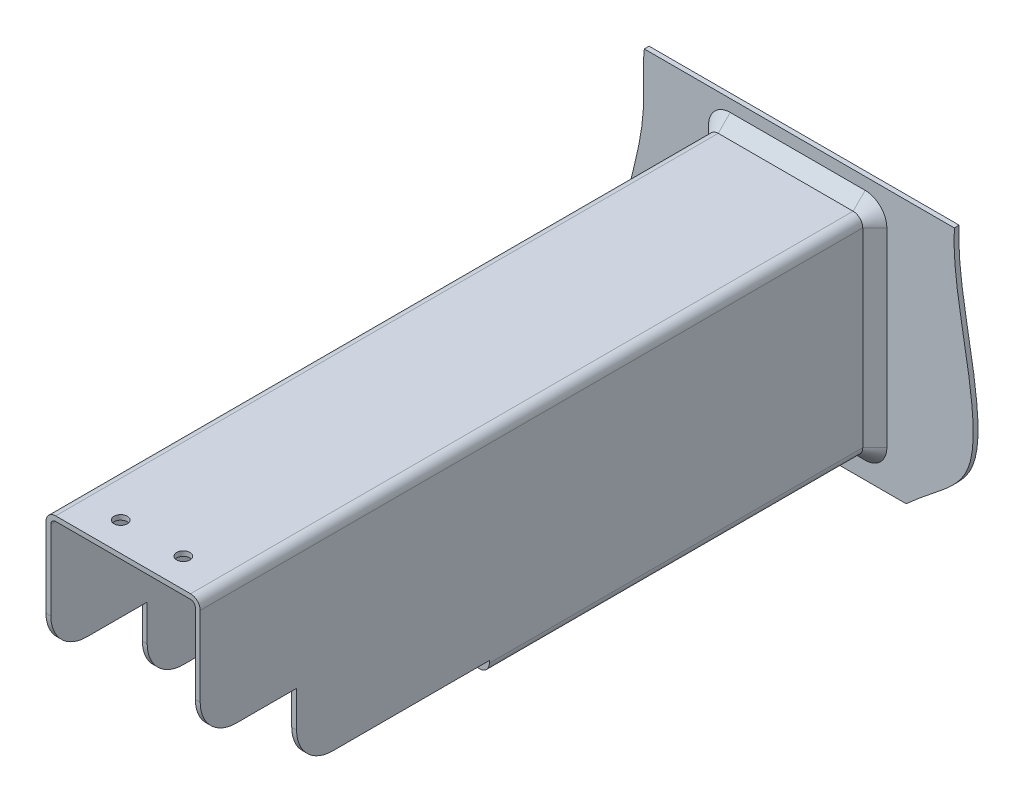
ISO-10303-21;
HEADER;
FILE_DESCRIPTION(('STEP AP214'),'2;1');
FILE_NAME('part.step','',(''),(''),'','','');
FILE_SCHEMA(('AUTOMOTIVE_DESIGN { 1 0 10303 214 1 1 1 1 }'));
ENDSEC;
DATA;
#1=APPLICATION_CONTEXT('core data for automotive mechanical design processes');
#2=APPLICATION_PROTOCOL_DEFINITION('international standard','automotive_design',2000,#1);
#3=PRODUCT_CONTEXT('',#1,'mechanical');
#4=PRODUCT('Part','Part','',(#3));
#5=PRODUCT_RELATED_PRODUCT_CATEGORY('part','',(#4));
#6=PRODUCT_DEFINITION_FORMATION('','',#4);
#7=PRODUCT_DEFINITION_CONTEXT('part definition',#1,'design');
#8=PRODUCT_DEFINITION('design','',#6,#7);
#9=PRODUCT_DEFINITION_SHAPE('','',#8);
#10=(LENGTH_UNIT() NAMED_UNIT(*) SI_UNIT(.MILLI.,.METRE.));
#11=(NAMED_UNIT(*) PLANE_ANGLE_UNIT() SI_UNIT($,.RADIAN.));
#12=(NAMED_UNIT(*) SI_UNIT($,.STERADIAN.) SOLID_ANGLE_UNIT());
#13=UNCERTAINTY_MEASURE_WITH_UNIT(LENGTH_MEASURE(1.E-05),#10,'distance_accuracy_value','');
#14=(GEOMETRIC_REPRESENTATION_CONTEXT(3) GLOBAL_UNCERTAINTY_ASSIGNED_CONTEXT((#13)) GLOBAL_UNIT_ASSIGNED_CONTEXT((#10,
#11,#12)) REPRESENTATION_CONTEXT('',''));
#15=CARTESIAN_POINT('',(0.,0.,0.));
#16=DIRECTION('',(0.,0.,1.));
#17=DIRECTION('',(1.,0.,0.));
#18=AXIS2_PLACEMENT_3D('',#15,#16,#17);
#19=CARTESIAN_POINT('',(30.,-50.,0.));
#20=DIRECTION('',(-1.,0.,0.));
#21=DIRECTION('',(0.,0.,1.));
#22=AXIS2_PLACEMENT_3D('',#19,#20,#21);
#23=PLANE('',#22);
#24=DIRECTION('',(0.,1.,0.));
#25=VECTOR('',#24,1.);
#26=CARTESIAN_POINT('',(30.,-50.,-280.));
#27=LINE('',#26,#25);
#28=CARTESIAN_POINT('',(30.,-81.,-280.));
#29=VERTEX_POINT('',#28);
#30=CARTESIAN_POINT('',(30.,-2.00000000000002,-280.));
#31=VERTEX_POINT('',#30);
#32=EDGE_CURVE('E617',#29,#31,#27,.T.);
#33=ORIENTED_EDGE('',*,*,#32,.F.);
#34=DIRECTION('',(0.,0.,-1.));
#35=VECTOR('',#34,1.);
#36=CARTESIAN_POINT('',(30.,-81.,0.));
#37=LINE('',#36,#35);
#38=CARTESIAN_POINT('',(30.,-81.,-120.));
#39=VERTEX_POINT('',#38);
#40=EDGE_CURVE('E533',#29,#39,#37,.F.);
#41=ORIENTED_EDGE('',*,*,#40,.T.);
#42=DIRECTION('',(0.,-1.,0.));
#43=VECTOR('',#42,1.);
#44=CARTESIAN_POINT('',(30.,-50.,-120.));
#45=LINE('',#44,#43);
#46=CARTESIAN_POINT('',(30.,-80.,-120.));
#47=VERTEX_POINT('',#46);
#48=EDGE_CURVE('E300',#47,#39,#45,.T.);
#49=ORIENTED_EDGE('',*,*,#48,.F.);
#50=DIRECTION('',(0.,0.,-1.));
#51=VECTOR('',#50,1.);
#52=CARTESIAN_POINT('',(30.,-80.,0.));
#53=LINE('',#52,#51);
#54=CARTESIAN_POINT('',(30.,-80.,-55.));
#55=VERTEX_POINT('',#54);
#56=EDGE_CURVE('E287',#55,#47,#53,.T.);
#57=ORIENTED_EDGE('',*,*,#56,.F.);
#58=CARTESIAN_POINT('',(30.,-65.,-55.));
#59=DIRECTION('',(-1.,0.,0.));
#60=DIRECTION('',(0.,0.,1.));
#61=AXIS2_PLACEMENT_3D('',#58,#59,#60);
#62=CIRCLE('',#61,15.);
#63=CARTESIAN_POINT('',(30.,-65.,-40.));
#64=VERTEX_POINT('',#63);
#65=EDGE_CURVE('E599',#55,#64,#62,.T.);
#66=ORIENTED_EDGE('',*,*,#65,.T.);
#67=DIRECTION('',(0.,-1.,0.));
#68=VECTOR('',#67,1.);
#69=CARTESIAN_POINT('',(30.,-50.,-40.));
#70=LINE('',#69,#68);
#71=CARTESIAN_POINT('',(30.,-50.,-40.));
#72=VERTEX_POINT('',#71);
#73=EDGE_CURVE('E774',#72,#64,#70,.T.);
#74=ORIENTED_EDGE('',*,*,#73,.F.);
#75=DIRECTION('',(0.,0.,1.));
#76=VECTOR('',#75,1.);
#77=CARTESIAN_POINT('',(30.,-50.,0.));
#78=LINE('',#77,#76);
#79=CARTESIAN_POINT('',(30.,-50.,-15.));
#80=VERTEX_POINT('',#79);
#81=EDGE_CURVE('E571',#72,#80,#78,.T.);
#82=ORIENTED_EDGE('',*,*,#81,.T.);
#83=CARTESIAN_POINT('',(30.,-35.,-15.));
#84=DIRECTION('',(-1.,0.,0.));
#85=DIRECTION('',(0.,0.,1.));
#86=AXIS2_PLACEMENT_3D('',#83,#84,#85);
#87=CIRCLE('',#86,15.);
#88=CARTESIAN_POINT('',(30.,-35.,0.));
#89=VERTEX_POINT('',#88);
#90=EDGE_CURVE('E676',#80,#89,#87,.T.);
#91=ORIENTED_EDGE('',*,*,#90,.T.);
#92=DIRECTION('',(0.,1.,0.));
#93=VECTOR('',#92,1.);
#94=CARTESIAN_POINT('',(30.,-50.,0.));
#95=LINE('',#94,#93);
#96=CARTESIAN_POINT('',(30.,-2.00000000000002,0.));
#97=VERTEX_POINT('',#96);
#98=EDGE_CURVE('E572',#89,#97,#95,.T.);
#99=ORIENTED_EDGE('',*,*,#98,.T.);
#100=DIRECTION('',(0.,0.,1.));
#101=VECTOR('',#100,1.);
#102=CARTESIAN_POINT('',(30.,-2.,-280.));
#103=LINE('',#102,#101);
#104=EDGE_CURVE('E642',#97,#31,#103,.F.);
#105=ORIENTED_EDGE('',*,*,#104,.T.);
#106=EDGE_LOOP('',(#33,#41,#49,#57,#66,#74,#82,#91,#99,#105));
#107=FACE_BOUND('',#106,.T.);
#108=ADVANCED_FACE('F31',(#107),#23,.T.);
#109=CARTESIAN_POINT('',(-30.,-50.,-280.));
#110=DIRECTION('',(1.,0.,0.));
#111=DIRECTION('',(0.,0.,-1.));
#112=AXIS2_PLACEMENT_3D('',#109,#110,#111);
#113=PLANE('',#112);
#114=DIRECTION('',(0.,-1.,0.));
#115=VECTOR('',#114,1.);
#116=CARTESIAN_POINT('',(-30.,-50.,-40.));
#117=LINE('',#116,#115);
#118=CARTESIAN_POINT('',(-30.,-50.,-40.));
#119=VERTEX_POINT('',#118);
#120=CARTESIAN_POINT('',(-30.,-65.,-40.));
#121=VERTEX_POINT('',#120);
#122=EDGE_CURVE('E766',#119,#121,#117,.T.);
#123=ORIENTED_EDGE('',*,*,#122,.T.);
#124=CARTESIAN_POINT('',(-30.,-65.,-55.));
#125=DIRECTION('',(1.,0.,0.));
#126=DIRECTION('',(0.,0.,-1.));
#127=AXIS2_PLACEMENT_3D('',#124,#125,#126);
#128=CIRCLE('',#127,15.);
#129=CARTESIAN_POINT('',(-30.,-80.,-55.));
#130=VERTEX_POINT('',#129);
#131=EDGE_CURVE('E607',#121,#130,#128,.T.);
#132=ORIENTED_EDGE('',*,*,#131,.T.);
#133=DIRECTION('',(0.,0.,1.));
#134=VECTOR('',#133,1.);
#135=CARTESIAN_POINT('',(-30.,-80.,-280.));
#136=LINE('',#135,#134);
#137=CARTESIAN_POINT('',(-30.,-80.,-120.));
#138=VERTEX_POINT('',#137);
#139=EDGE_CURVE('E305',#138,#130,#136,.T.);
#140=ORIENTED_EDGE('',*,*,#139,.F.);
#141=DIRECTION('',(0.,1.,0.));
#142=VECTOR('',#141,1.);
#143=CARTESIAN_POINT('',(-30.,-50.,-120.));
#144=LINE('',#143,#142);
#145=CARTESIAN_POINT('',(-30.,-81.,-120.));
#146=VERTEX_POINT('',#145);
#147=EDGE_CURVE('E297',#146,#138,#144,.T.);
#148=ORIENTED_EDGE('',*,*,#147,.F.);
#149=DIRECTION('',(0.,0.,-1.));
#150=VECTOR('',#149,1.);
#151=CARTESIAN_POINT('',(-30.,-81.,-280.));
#152=LINE('',#151,#150);
#153=CARTESIAN_POINT('',(-30.,-81.,-280.));
#154=VERTEX_POINT('',#153);
#155=EDGE_CURVE('E499',#146,#154,#152,.T.);
#156=ORIENTED_EDGE('',*,*,#155,.T.);
#157=DIRECTION('',(0.,1.,0.));
#158=VECTOR('',#157,1.);
#159=CARTESIAN_POINT('',(-30.,-50.,-280.));
#160=LINE('',#159,#158);
#161=CARTESIAN_POINT('',(-30.,-2.00000000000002,-280.));
#162=VERTEX_POINT('',#161);
#163=EDGE_CURVE('E580',#154,#162,#160,.T.);
#164=ORIENTED_EDGE('',*,*,#163,.T.);
#165=DIRECTION('',(0.,0.,1.));
#166=VECTOR('',#165,1.);
#167=CARTESIAN_POINT('',(-30.,-2.,0.));
#168=LINE('',#167,#166);
#169=CARTESIAN_POINT('',(-30.,-2.00000000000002,0.));
#170=VERTEX_POINT('',#169);
#171=EDGE_CURVE('E645',#162,#170,#168,.T.);
#172=ORIENTED_EDGE('',*,*,#171,.T.);
#173=DIRECTION('',(0.,1.,0.));
#174=VECTOR('',#173,1.);
#175=CARTESIAN_POINT('',(-30.,-50.,0.));
#176=LINE('',#175,#174);
#177=CARTESIAN_POINT('',(-30.,-35.,0.));
#178=VERTEX_POINT('',#177);
#179=EDGE_CURVE('E568',#178,#170,#176,.T.);
#180=ORIENTED_EDGE('',*,*,#179,.F.);
#181=CARTESIAN_POINT('',(-30.,-35.,-15.));
#182=DIRECTION('',(1.,0.,0.));
#183=DIRECTION('',(0.,0.,-1.));
#184=AXIS2_PLACEMENT_3D('',#181,#182,#183);
#185=CIRCLE('',#184,15.);
#186=CARTESIAN_POINT('',(-30.,-50.,-15.));
#187=VERTEX_POINT('',#186);
#188=EDGE_CURVE('E678',#178,#187,#185,.T.);
#189=ORIENTED_EDGE('',*,*,#188,.T.);
#190=DIRECTION('',(0.,0.,-1.));
#191=VECTOR('',#190,1.);
#192=CARTESIAN_POINT('',(-30.,-50.,-280.));
#193=LINE('',#192,#191);
#194=EDGE_CURVE('E691',#187,#119,#193,.T.);
#195=ORIENTED_EDGE('',*,*,#194,.T.);
#196=EDGE_LOOP('',(#123,#132,#140,#148,#156,#164,#172,#180,#189,#195));
#197=FACE_BOUND('',#196,.T.);
#198=ADVANCED_FACE('F414',(#197),#113,.T.);
#199=CARTESIAN_POINT('',(72.2561771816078,-47.5326698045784,-280.));
#200=DIRECTION('',(0.,0.,-1.));
#201=DIRECTION('',(-1.,0.,0.));
#202=AXIS2_PLACEMENT_3D('',#199,#200,#201);
#203=PLANE('',#202);
#204=CARTESIAN_POINT('',(0.,-45.,-280.));
#205=DIRECTION('',(0.,0.,-1.));
#206=DIRECTION('',(-1.,0.,0.));
#207=AXIS2_PLACEMENT_3D('',#204,#205,#206);
#208=CIRCLE('',#207,27.5);
#209=CARTESIAN_POINT('',(-27.5,-45.,-280.));
#210=VERTEX_POINT('',#209);
#211=EDGE_CURVE('E315',#210,#210,#208,.T.);
#212=ORIENTED_EDGE('',*,*,#211,.T.);
#213=EDGE_LOOP('',(#212));
#214=FACE_BOUND('',#213,.T.);
#215=DIRECTION('',(-1.,0.,0.));
#216=VECTOR('',#215,1.);
#217=CARTESIAN_POINT('',(30.,-83.,-280.));
#218=LINE('',#217,#216);
#219=CARTESIAN_POINT('',(28.,-83.,-280.));
#220=VERTEX_POINT('',#219);
#221=CARTESIAN_POINT('',(-28.,-83.,-280.));
#222=VERTEX_POINT('',#221);
#223=EDGE_CURVE('E309',#220,#222,#218,.T.);
#224=ORIENTED_EDGE('',*,*,#223,.F.);
#225=CARTESIAN_POINT('',(28.,-81.,-280.));
#226=DIRECTION('',(0.,0.,-1.));
#227=DIRECTION('',(-1.,0.,0.));
#228=AXIS2_PLACEMENT_3D('',#225,#226,#227);
#229=CIRCLE('',#228,2.);
#230=EDGE_CURVE('E616',#220,#29,#229,.F.);
#231=ORIENTED_EDGE('',*,*,#230,.T.);
#232=ORIENTED_EDGE('',*,*,#32,.T.);
#233=CARTESIAN_POINT('',(28.,-2.,-280.));
#234=DIRECTION('',(0.,0.,-1.));
#235=DIRECTION('',(-1.,0.,0.));
#236=AXIS2_PLACEMENT_3D('',#233,#234,#235);
#237=CIRCLE('',#236,2.);
#238=CARTESIAN_POINT('',(28.,0.,-280.));
#239=VERTEX_POINT('',#238);
#240=EDGE_CURVE('E651',#31,#239,#237,.F.);
#241=ORIENTED_EDGE('',*,*,#240,.T.);
#242=DIRECTION('',(1.,0.,0.));
#243=VECTOR('',#242,1.);
#244=CARTESIAN_POINT('',(-30.,0.,-280.));
#245=LINE('',#244,#243);
#246=CARTESIAN_POINT('',(-28.,0.,-280.));
#247=VERTEX_POINT('',#246);
#248=EDGE_CURVE('E629',#247,#239,#245,.T.);
#249=ORIENTED_EDGE('',*,*,#248,.F.);
#250=CARTESIAN_POINT('',(-28.,-2.,-280.));
#251=DIRECTION('',(0.,0.,-1.));
#252=DIRECTION('',(-1.,0.,0.));
#253=AXIS2_PLACEMENT_3D('',#250,#251,#252);
#254=CIRCLE('',#253,2.);
#255=EDGE_CURVE('E656',#247,#162,#254,.F.);
#256=ORIENTED_EDGE('',*,*,#255,.T.);
#257=ORIENTED_EDGE('',*,*,#163,.F.);
#258=CARTESIAN_POINT('',(-28.,-81.,-280.));
#259=DIRECTION('',(0.,0.,-1.));
#260=DIRECTION('',(-1.,0.,0.));
#261=AXIS2_PLACEMENT_3D('',#258,#259,#260);
#262=CIRCLE('',#261,2.);
#263=EDGE_CURVE('E589',#154,#222,#262,.F.);
#264=ORIENTED_EDGE('',*,*,#263,.T.);
#265=EDGE_LOOP('',(#224,#231,#232,#241,#249,#256,#257,#264));
#266=FACE_BOUND('',#265,.T.);
#267=ADVANCED_FACE('F417',(#214,#266),#203,.F.);
#268=DIRECTION('',(0.,1.,0.));
#269=VECTOR('',#268,1.);
#270=CARTESIAN_POINT('',(-36.9999999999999,-47.5326698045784,-280.));
#271=LINE('',#270,#269);
#272=CARTESIAN_POINT('',(-36.9999999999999,-81.,-280.));
#273=VERTEX_POINT('',#272);
#274=CARTESIAN_POINT('',(-36.9999999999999,-2.,-280.));
#275=VERTEX_POINT('',#274);
#276=EDGE_CURVE('E531',#273,#275,#271,.T.);
#277=ORIENTED_EDGE('',*,*,#276,.T.);
#278=CARTESIAN_POINT('',(-28.,-2.,-280.));
#279=DIRECTION('',(0.,0.,-1.));
#280=DIRECTION('',(-1.,0.,0.));
#281=AXIS2_PLACEMENT_3D('',#278,#279,#280);
#282=CIRCLE('',#281,8.99999999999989);
#283=CARTESIAN_POINT('',(-28.,6.9999999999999,-280.));
#284=VERTEX_POINT('',#283);
#285=EDGE_CURVE('E480',#275,#284,#282,.T.);
#286=ORIENTED_EDGE('',*,*,#285,.T.);
#287=DIRECTION('',(1.,0.,0.));
#288=VECTOR('',#287,1.);
#289=CARTESIAN_POINT('',(72.2561771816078,6.9999999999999,-280.));
#290=LINE('',#289,#288);
#291=CARTESIAN_POINT('',(28.,6.9999999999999,-280.));
#292=VERTEX_POINT('',#291);
#293=EDGE_CURVE('E541',#284,#292,#290,.T.);
#294=ORIENTED_EDGE('',*,*,#293,.T.);
#295=CARTESIAN_POINT('',(28.,-2.,-280.));
#296=DIRECTION('',(0.,0.,-1.));
#297=DIRECTION('',(-1.,0.,0.));
#298=AXIS2_PLACEMENT_3D('',#295,#296,#297);
#299=CIRCLE('',#298,8.9999999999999);
#300=CARTESIAN_POINT('',(36.9999999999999,-2.,-280.));
#301=VERTEX_POINT('',#300);
#302=EDGE_CURVE('E466',#292,#301,#299,.T.);
#303=ORIENTED_EDGE('',*,*,#302,.T.);
#304=DIRECTION('',(0.,-1.,0.));
#305=VECTOR('',#304,1.);
#306=CARTESIAN_POINT('',(36.9999999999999,-47.5326698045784,-280.));
#307=LINE('',#306,#305);
#308=CARTESIAN_POINT('',(36.9999999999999,-81.,-280.));
#309=VERTEX_POINT('',#308);
#310=EDGE_CURVE('E514',#301,#309,#307,.T.);
#311=ORIENTED_EDGE('',*,*,#310,.T.);
#312=CARTESIAN_POINT('',(28.,-81.,-280.));
#313=DIRECTION('',(0.,0.,-1.));
#314=DIRECTION('',(-1.,0.,0.));
#315=AXIS2_PLACEMENT_3D('',#312,#313,#314);
#316=CIRCLE('',#315,8.9999999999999);
#317=CARTESIAN_POINT('',(28.,-89.9999999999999,-280.));
#318=VERTEX_POINT('',#317);
#319=EDGE_CURVE('E506',#309,#318,#316,.T.);
#320=ORIENTED_EDGE('',*,*,#319,.T.);
#321=DIRECTION('',(-1.,0.,0.));
#322=VECTOR('',#321,1.);
#323=CARTESIAN_POINT('',(72.2561771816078,-89.9999999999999,-280.));
#324=LINE('',#323,#322);
#325=CARTESIAN_POINT('',(-28.,-89.9999999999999,-280.));
#326=VERTEX_POINT('',#325);
#327=EDGE_CURVE('E525',#318,#326,#324,.T.);
#328=ORIENTED_EDGE('',*,*,#327,.T.);
#329=CARTESIAN_POINT('',(-28.,-81.,-280.));
#330=DIRECTION('',(0.,0.,-1.));
#331=DIRECTION('',(-1.,0.,0.));
#332=AXIS2_PLACEMENT_3D('',#329,#330,#331);
#333=CIRCLE('',#332,8.9999999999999);
#334=EDGE_CURVE('E528',#326,#273,#333,.T.);
#335=ORIENTED_EDGE('',*,*,#334,.T.);
#336=EDGE_LOOP('',(#277,#286,#294,#303,#311,#320,#328,#335));
#337=FACE_BOUND('',#336,.T.);
#338=CARTESIAN_POINT('',(65.0028169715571,12.,-280.));
#339=CARTESIAN_POINT('',(64.0242805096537,-7.44498994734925,-280.));
#340=CARTESIAN_POINT('',(72.7944981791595,-35.1423618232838,-280.));
#341=CARTESIAN_POINT('',(73.6269230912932,-75.7319305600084,-280.));
#342=CARTESIAN_POINT('',(55.9113419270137,-87.4715838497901,-280.));
#343=CARTESIAN_POINT('',(47.3063028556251,-95.1486708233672,-280.));
#344=CARTESIAN_POINT('',(45.0158088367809,-97.1519307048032,-280.));
#345=B_SPLINE_CURVE_WITH_KNOTS('',3,(#338,#339,#340,#341,#342,#343,#344),.UNSPECIFIED.,.F.,.F.,
(4,1,1,1,4),(0.0818279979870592,0.237024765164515,0.305107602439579,0.367556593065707,
0.390469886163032),.UNSPECIFIED.);
#346=CARTESIAN_POINT('',(65.0028169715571,12.,-280.));
#347=VERTEX_POINT('',#346);
#348=CARTESIAN_POINT('',(45.0158088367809,-97.1519307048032,-280.));
#349=VERTEX_POINT('',#348);
#350=EDGE_CURVE('E321',#347,#349,#345,.T.);
#351=ORIENTED_EDGE('',*,*,#350,.F.);
#352=DIRECTION('',(1.,0.,0.));
#353=VECTOR('',#352,1.);
#354=CARTESIAN_POINT('',(65.0028169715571,12.,-280.));
#355=LINE('',#354,#353);
#356=CARTESIAN_POINT('',(-63.6642985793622,12.,-280.));
#357=VERTEX_POINT('',#356);
#358=EDGE_CURVE('E335',#357,#347,#355,.T.);
#359=ORIENTED_EDGE('',*,*,#358,.F.);
#360=CARTESIAN_POINT('',(-57.1345434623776,-97.1519307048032,-280.));
#361=CARTESIAN_POINT('',(-59.9947760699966,-95.6998642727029,-280.));
#362=CARTESIAN_POINT('',(-65.5111904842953,-91.9010356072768,-280.));
#363=CARTESIAN_POINT('',(-78.6781137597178,-71.818203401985,-280.));
#364=CARTESIAN_POINT('',(-69.4406927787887,-40.0563333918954,-280.));
#365=CARTESIAN_POINT('',(-62.8452680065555,-10.6602062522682,-280.));
#366=CARTESIAN_POINT('',(-64.4181684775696,6.80657451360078,-280.));
#367=CARTESIAN_POINT('',(-63.6642985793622,12.,-280.));
#368=B_SPLINE_CURVE_WITH_KNOTS('',3,(#360,#361,#362,#363,#364,#365,#366,#367),.UNSPECIFIED.,.F.,
.F.,(4,1,1,1,1,4),(0.662928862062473,0.688395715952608,0.7166895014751,0.840001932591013,
0.913092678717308,0.960753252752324),.UNSPECIFIED.);
#369=CARTESIAN_POINT('',(-57.1345434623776,-97.1519307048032,-280.));
#370=VERTEX_POINT('',#369);
#371=EDGE_CURVE('E331',#370,#357,#368,.T.);
#372=ORIENTED_EDGE('',*,*,#371,.F.);
#373=DIRECTION('',(-1.,0.,0.));
#374=VECTOR('',#373,1.);
#375=CARTESIAN_POINT('',(45.0158088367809,-97.1519307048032,-280.));
#376=LINE('',#375,#374);
#377=EDGE_CURVE('E326',#349,#370,#376,.T.);
#378=ORIENTED_EDGE('',*,*,#377,.F.);
#379=EDGE_LOOP('',(#351,#359,#372,#378));
#380=FACE_BOUND('',#379,.T.);
#381=ADVANCED_FACE('F409',(#337,#380),#203,.F.);
#382=CARTESIAN_POINT('',(-30.,-50.,0.));
#383=DIRECTION('',(0.,-1.,0.));
#384=DIRECTION('',(0.,0.,-1.));
#385=AXIS2_PLACEMENT_3D('',#382,#383,#384);
#386=PLANE('',#385);
#387=DIRECTION('',(0.,0.,1.));
#388=VECTOR('',#387,1.);
#389=CARTESIAN_POINT('',(-32.,-50.,-280.));
#390=LINE('',#389,#388);
#391=CARTESIAN_POINT('',(-32.,-50.,-40.));
#392=VERTEX_POINT('',#391);
#393=CARTESIAN_POINT('',(-32.,-50.,-15.));
#394=VERTEX_POINT('',#393);
#395=EDGE_CURVE('E577',#392,#394,#390,.T.);
#396=ORIENTED_EDGE('',*,*,#395,.F.);
#397=DIRECTION('',(-1.,0.,0.));
#398=VECTOR('',#397,1.);
#399=CARTESIAN_POINT('',(-30.,-50.,-40.));
#400=LINE('',#399,#398);
#401=EDGE_CURVE('E769',#119,#392,#400,.T.);
#402=ORIENTED_EDGE('',*,*,#401,.F.);
#403=ORIENTED_EDGE('',*,*,#194,.F.);
#404=DIRECTION('',(1.,0.,0.));
#405=VECTOR('',#404,1.);
#406=CARTESIAN_POINT('',(-32.,-50.,-15.));
#407=LINE('',#406,#405);
#408=EDGE_CURVE('E683',#187,#394,#407,.F.);
#409=ORIENTED_EDGE('',*,*,#408,.T.);
#410=EDGE_LOOP('',(#396,#402,#403,#409));
#411=FACE_BOUND('',#410,.T.);
#412=ADVANCED_FACE('F405',(#411),#386,.T.);
#413=CARTESIAN_POINT('',(-30.,2.,-280.));
#414=DIRECTION('',(0.,1.,0.));
#415=DIRECTION('',(0.,0.,1.));
#416=AXIS2_PLACEMENT_3D('',#413,#414,#415);
#417=PLANE('',#416);
#418=CARTESIAN_POINT('',(-13.,2.,-12.));
#419=DIRECTION('',(0.,1.,0.));
#420=DIRECTION('',(0.,0.,1.));
#421=AXIS2_PLACEMENT_3D('',#418,#419,#420);
#422=CIRCLE('',#421,2.75);
#423=CARTESIAN_POINT('',(-13.,2.,-9.25));
#424=VERTEX_POINT('',#423);
#425=EDGE_CURVE('E439',#424,#424,#422,.T.);
#426=ORIENTED_EDGE('',*,*,#425,.F.);
#427=EDGE_LOOP('',(#426));
#428=FACE_BOUND('',#427,.T.);
#429=CARTESIAN_POINT('',(13.,2.,-12.));
#430=DIRECTION('',(0.,1.,0.));
#431=DIRECTION('',(0.,0.,1.));
#432=AXIS2_PLACEMENT_3D('',#429,#430,#431);
#433=CIRCLE('',#432,2.75);
#434=CARTESIAN_POINT('',(13.,2.,-9.25));
#435=VERTEX_POINT('',#434);
#436=EDGE_CURVE('E443',#435,#435,#433,.T.);
#437=ORIENTED_EDGE('',*,*,#436,.F.);
#438=EDGE_LOOP('',(#437));
#439=FACE_BOUND('',#438,.T.);
#440=DIRECTION('',(0.,0.,-1.));
#441=VECTOR('',#440,1.);
#442=CARTESIAN_POINT('',(28.,2.,-280.));
#443=LINE('',#442,#441);
#444=CARTESIAN_POINT('',(28.,2.,0.));
#445=VERTEX_POINT('',#444);
#446=CARTESIAN_POINT('',(28.,2.,-275.));
#447=VERTEX_POINT('',#446);
#448=EDGE_CURVE('E447',#445,#447,#443,.T.);
#449=ORIENTED_EDGE('',*,*,#448,.T.);
#450=DIRECTION('',(-1.,0.,0.));
#451=VECTOR('',#450,1.);
#452=CARTESIAN_POINT('',(-30.,2.,-275.));
#453=LINE('',#452,#451);
#454=CARTESIAN_POINT('',(-28.,2.,-275.));
#455=VERTEX_POINT('',#454);
#456=EDGE_CURVE('E450',#447,#455,#453,.T.);
#457=ORIENTED_EDGE('',*,*,#456,.T.);
#458=DIRECTION('',(0.,0.,1.));
#459=VECTOR('',#458,1.);
#460=CARTESIAN_POINT('',(-28.,2.,-280.));
#461=LINE('',#460,#459);
#462=CARTESIAN_POINT('',(-28.,2.,0.));
#463=VERTEX_POINT('',#462);
#464=EDGE_CURVE('E456',#455,#463,#461,.T.);
#465=ORIENTED_EDGE('',*,*,#464,.T.);
#466=DIRECTION('',(-1.,0.,0.));
#467=VECTOR('',#466,1.);
#468=CARTESIAN_POINT('',(-30.,2.,0.));
#469=LINE('',#468,#467);
#470=EDGE_CURVE('E453',#445,#463,#469,.T.);
#471=ORIENTED_EDGE('',*,*,#470,.F.);
#472=EDGE_LOOP('',(#449,#457,#465,#471));
#473=FACE_BOUND('',#472,.T.);
#474=ADVANCED_FACE('F408',(#428,#439,#473),#417,.T.);
#475=CARTESIAN_POINT('',(-30.,0.,-280.));
#476=DIRECTION('',(0.,-1.,0.));
#477=DIRECTION('',(0.,0.,-1.));
#478=AXIS2_PLACEMENT_3D('',#475,#476,#477);
#479=PLANE('',#478);
#480=CARTESIAN_POINT('',(-13.,0.,-12.));
#481=DIRECTION('',(0.,-1.,0.));
#482=DIRECTION('',(0.,0.,-1.));
#483=AXIS2_PLACEMENT_3D('',#480,#481,#482);
#484=CIRCLE('',#483,2.75);
#485=CARTESIAN_POINT('',(-13.,0.,-9.25));
#486=VERTEX_POINT('',#485);
#487=EDGE_CURVE('E692',#486,#486,#484,.T.);
#488=ORIENTED_EDGE('',*,*,#487,.F.);
#489=EDGE_LOOP('',(#488));
#490=FACE_BOUND('',#489,.T.);
#491=CARTESIAN_POINT('',(13.,0.,-12.));
#492=DIRECTION('',(0.,-1.,0.));
#493=DIRECTION('',(0.,0.,-1.));
#494=AXIS2_PLACEMENT_3D('',#491,#492,#493);
#495=CIRCLE('',#494,2.75);
#496=CARTESIAN_POINT('',(13.,0.,-9.25));
#497=VERTEX_POINT('',#496);
#498=EDGE_CURVE('E688',#497,#497,#495,.T.);
#499=ORIENTED_EDGE('',*,*,#498,.F.);
#500=EDGE_LOOP('',(#499));
#501=FACE_BOUND('',#500,.T.);
#502=ORIENTED_EDGE('',*,*,#248,.T.);
#503=DIRECTION('',(0.,0.,1.));
#504=VECTOR('',#503,1.);
#505=CARTESIAN_POINT('',(28.,0.,0.));
#506=LINE('',#505,#504);
#507=CARTESIAN_POINT('',(28.,0.,0.));
#508=VERTEX_POINT('',#507);
#509=EDGE_CURVE('E639',#239,#508,#506,.T.);
#510=ORIENTED_EDGE('',*,*,#509,.T.);
#511=DIRECTION('',(1.,0.,0.));
#512=VECTOR('',#511,1.);
#513=CARTESIAN_POINT('',(-30.,0.,0.));
#514=LINE('',#513,#512);
#515=CARTESIAN_POINT('',(-28.,0.,0.));
#516=VERTEX_POINT('',#515);
#517=EDGE_CURVE('E620',#516,#508,#514,.T.);
#518=ORIENTED_EDGE('',*,*,#517,.F.);
#519=DIRECTION('',(0.,0.,1.));
#520=VECTOR('',#519,1.);
#521=CARTESIAN_POINT('',(-28.,0.,-280.));
#522=LINE('',#521,#520);
#523=EDGE_CURVE('E637',#516,#247,#522,.F.);
#524=ORIENTED_EDGE('',*,*,#523,.T.);
#525=EDGE_LOOP('',(#502,#510,#518,#524));
#526=FACE_BOUND('',#525,.T.);
#527=ADVANCED_FACE('F33',(#490,#501,#526),#479,.T.);
#528=CARTESIAN_POINT('',(-30.,2.,0.));
#529=DIRECTION('',(0.,0.,-1.));
#530=DIRECTION('',(-1.,0.,0.));
#531=AXIS2_PLACEMENT_3D('',#528,#529,#530);
#532=PLANE('',#531);
#533=ORIENTED_EDGE('',*,*,#98,.F.);
#534=DIRECTION('',(1.,0.,0.));
#535=VECTOR('',#534,1.);
#536=CARTESIAN_POINT('',(32.,-35.,0.));
#537=LINE('',#536,#535);
#538=CARTESIAN_POINT('',(32.,-35.,0.));
#539=VERTEX_POINT('',#538);
#540=EDGE_CURVE('E562',#89,#539,#537,.T.);
#541=ORIENTED_EDGE('',*,*,#540,.T.);
#542=DIRECTION('',(0.,1.,0.));
#543=VECTOR('',#542,1.);
#544=CARTESIAN_POINT('',(32.,-50.,0.));
#545=LINE('',#544,#543);
#546=CARTESIAN_POINT('',(32.,-2.00000000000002,0.));
#547=VERTEX_POINT('',#546);
#548=EDGE_CURVE('E621',#539,#547,#545,.T.);
#549=ORIENTED_EDGE('',*,*,#548,.T.);
#550=CARTESIAN_POINT('',(28.,-2.,0.));
#551=DIRECTION('',(0.,0.,-1.));
#552=DIRECTION('',(-1.,0.,0.));
#553=AXIS2_PLACEMENT_3D('',#550,#551,#552);
#554=CIRCLE('',#553,4.);
#555=EDGE_CURVE('E559',#547,#445,#554,.F.);
#556=ORIENTED_EDGE('',*,*,#555,.T.);
#557=ORIENTED_EDGE('',*,*,#470,.T.);
#558=CARTESIAN_POINT('',(-28.,-2.,0.));
#559=DIRECTION('',(0.,0.,-1.));
#560=DIRECTION('',(-1.,0.,0.));
#561=AXIS2_PLACEMENT_3D('',#558,#559,#560);
#562=CIRCLE('',#561,4.);
#563=CARTESIAN_POINT('',(-32.,-2.00000000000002,0.));
#564=VERTEX_POINT('',#563);
#565=EDGE_CURVE('E564',#463,#564,#562,.F.);
#566=ORIENTED_EDGE('',*,*,#565,.T.);
#567=DIRECTION('',(0.,1.,0.));
#568=VECTOR('',#567,1.);
#569=CARTESIAN_POINT('',(-32.,-50.,0.));
#570=LINE('',#569,#568);
#571=CARTESIAN_POINT('',(-32.,-35.,0.));
#572=VERTEX_POINT('',#571);
#573=EDGE_CURVE('E556',#572,#564,#570,.T.);
#574=ORIENTED_EDGE('',*,*,#573,.F.);
#575=DIRECTION('',(1.,0.,0.));
#576=VECTOR('',#575,1.);
#577=CARTESIAN_POINT('',(-30.,-35.,0.));
#578=LINE('',#577,#576);
#579=EDGE_CURVE('E558',#572,#178,#578,.T.);
#580=ORIENTED_EDGE('',*,*,#579,.T.);
#581=ORIENTED_EDGE('',*,*,#179,.T.);
#582=CARTESIAN_POINT('',(-28.,-2.,0.));
#583=DIRECTION('',(0.,0.,-1.));
#584=DIRECTION('',(-1.,0.,0.));
#585=AXIS2_PLACEMENT_3D('',#582,#583,#584);
#586=CIRCLE('',#585,2.);
#587=EDGE_CURVE('E654',#170,#516,#586,.T.);
#588=ORIENTED_EDGE('',*,*,#587,.T.);
#589=ORIENTED_EDGE('',*,*,#517,.T.);
#590=CARTESIAN_POINT('',(28.,-2.,0.));
#591=DIRECTION('',(0.,0.,-1.));
#592=DIRECTION('',(-1.,0.,0.));
#593=AXIS2_PLACEMENT_3D('',#590,#591,#592);
#594=CIRCLE('',#593,2.);
#595=EDGE_CURVE('E648',#508,#97,#594,.T.);
#596=ORIENTED_EDGE('',*,*,#595,.T.);
#597=EDGE_LOOP('',(#533,#541,#549,#556,#557,#566,#574,#580,#581,#588,#589,#596));
#598=FACE_BOUND('',#597,.T.);
#599=ADVANCED_FACE('F424',(#598),#532,.F.);
#600=CARTESIAN_POINT('',(32.,-50.,0.));
#601=DIRECTION('',(1.,0.,0.));
#602=DIRECTION('',(0.,0.,-1.));
#603=AXIS2_PLACEMENT_3D('',#600,#601,#602);
#604=PLANE('',#603);
#605=DIRECTION('',(0.,0.,-1.));
#606=VECTOR('',#605,1.);
#607=CARTESIAN_POINT('',(32.,-81.,0.));
#608=LINE('',#607,#606);
#609=CARTESIAN_POINT('',(32.,-81.,-120.));
#610=VERTEX_POINT('',#609);
#611=CARTESIAN_POINT('',(32.,-81.,-275.));
#612=VERTEX_POINT('',#611);
#613=EDGE_CURVE('E491',#610,#612,#608,.T.);
#614=ORIENTED_EDGE('',*,*,#613,.T.);
#615=DIRECTION('',(0.,1.,0.));
#616=VECTOR('',#615,1.);
#617=CARTESIAN_POINT('',(32.,-50.,-275.));
#618=LINE('',#617,#616);
#619=CARTESIAN_POINT('',(32.,-2.,-275.));
#620=VERTEX_POINT('',#619);
#621=EDGE_CURVE('E477',#612,#620,#618,.T.);
#622=ORIENTED_EDGE('',*,*,#621,.T.);
#623=DIRECTION('',(0.,0.,-1.));
#624=VECTOR('',#623,1.);
#625=CARTESIAN_POINT('',(32.,-2.,0.));
#626=LINE('',#625,#624);
#627=EDGE_CURVE('E455',#620,#547,#626,.F.);
#628=ORIENTED_EDGE('',*,*,#627,.T.);
#629=ORIENTED_EDGE('',*,*,#548,.F.);
#630=CARTESIAN_POINT('',(32.,-35.,-15.));
#631=DIRECTION('',(1.,0.,0.));
#632=DIRECTION('',(0.,0.,-1.));
#633=AXIS2_PLACEMENT_3D('',#630,#631,#632);
#634=CIRCLE('',#633,15.);
#635=CARTESIAN_POINT('',(32.,-50.,-15.));
#636=VERTEX_POINT('',#635);
#637=EDGE_CURVE('E665',#539,#636,#634,.T.);
#638=ORIENTED_EDGE('',*,*,#637,.T.);
#639=DIRECTION('',(0.,0.,-1.));
#640=VECTOR('',#639,1.);
#641=CARTESIAN_POINT('',(32.,-50.,0.));
#642=LINE('',#641,#640);
#643=CARTESIAN_POINT('',(32.,-50.,-40.));
#644=VERTEX_POINT('',#643);
#645=EDGE_CURVE('E624',#636,#644,#642,.T.);
#646=ORIENTED_EDGE('',*,*,#645,.T.);
#647=DIRECTION('',(0.,-1.,0.));
#648=VECTOR('',#647,1.);
#649=CARTESIAN_POINT('',(32.,-50.,-40.));
#650=LINE('',#649,#648);
#651=CARTESIAN_POINT('',(32.,-65.,-40.));
#652=VERTEX_POINT('',#651);
#653=EDGE_CURVE('E772',#644,#652,#650,.T.);
#654=ORIENTED_EDGE('',*,*,#653,.T.);
#655=CARTESIAN_POINT('',(32.,-65.,-55.));
#656=DIRECTION('',(1.,0.,0.));
#657=DIRECTION('',(0.,0.,-1.));
#658=AXIS2_PLACEMENT_3D('',#655,#656,#657);
#659=CIRCLE('',#658,15.);
#660=CARTESIAN_POINT('',(32.,-80.,-55.0000000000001));
#661=VERTEX_POINT('',#660);
#662=EDGE_CURVE('E293',#652,#661,#659,.T.);
#663=ORIENTED_EDGE('',*,*,#662,.T.);
#664=DIRECTION('',(0.,0.,1.));
#665=VECTOR('',#664,1.);
#666=CARTESIAN_POINT('',(32.,-80.,-120.));
#667=LINE('',#666,#665);
#668=CARTESIAN_POINT('',(32.,-80.,-120.));
#669=VERTEX_POINT('',#668);
#670=EDGE_CURVE('E278',#669,#661,#667,.T.);
#671=ORIENTED_EDGE('',*,*,#670,.F.);
#672=DIRECTION('',(0.,1.,0.));
#673=VECTOR('',#672,1.);
#674=CARTESIAN_POINT('',(32.,-85.,-120.));
#675=LINE('',#674,#673);
#676=EDGE_CURVE('E264',#610,#669,#675,.T.);
#677=ORIENTED_EDGE('',*,*,#676,.F.);
#678=EDGE_LOOP('',(#614,#622,#628,#629,#638,#646,#654,#663,#671,#677));
#679=FACE_BOUND('',#678,.T.);
#680=ADVANCED_FACE('F290',(#679),#604,.T.);
#681=CARTESIAN_POINT('',(30.,-50.,0.));
#682=DIRECTION('',(0.,-1.,0.));
#683=DIRECTION('',(0.,0.,-1.));
#684=AXIS2_PLACEMENT_3D('',#681,#682,#683);
#685=PLANE('',#684);
#686=DIRECTION('',(1.,0.,0.));
#687=VECTOR('',#686,1.);
#688=CARTESIAN_POINT('',(30.,-50.,-40.));
#689=LINE('',#688,#687);
#690=EDGE_CURVE('E675',#72,#644,#689,.T.);
#691=ORIENTED_EDGE('',*,*,#690,.T.);
#692=ORIENTED_EDGE('',*,*,#645,.F.);
#693=DIRECTION('',(1.,0.,0.));
#694=VECTOR('',#693,1.);
#695=CARTESIAN_POINT('',(30.,-50.,-15.));
#696=LINE('',#695,#694);
#697=EDGE_CURVE('E669',#636,#80,#696,.F.);
#698=ORIENTED_EDGE('',*,*,#697,.T.);
#699=ORIENTED_EDGE('',*,*,#81,.F.);
#700=EDGE_LOOP('',(#691,#692,#698,#699));
#701=FACE_BOUND('',#700,.T.);
#702=ADVANCED_FACE('F413',(#701),#685,.T.);
#703=CARTESIAN_POINT('',(-32.,-50.,-280.));
#704=DIRECTION('',(-1.,0.,0.));
#705=DIRECTION('',(0.,0.,1.));
#706=AXIS2_PLACEMENT_3D('',#703,#704,#705);
#707=PLANE('',#706);
#708=DIRECTION('',(0.,0.,1.));
#709=VECTOR('',#708,1.);
#710=CARTESIAN_POINT('',(-32.,-2.,-280.));
#711=LINE('',#710,#709);
#712=CARTESIAN_POINT('',(-32.,-2.,-275.));
#713=VERTEX_POINT('',#712);
#714=EDGE_CURVE('E554',#564,#713,#711,.F.);
#715=ORIENTED_EDGE('',*,*,#714,.T.);
#716=DIRECTION('',(0.,-1.,0.));
#717=VECTOR('',#716,1.);
#718=CARTESIAN_POINT('',(-32.,-50.,-275.));
#719=LINE('',#718,#717);
#720=CARTESIAN_POINT('',(-32.,-81.,-275.));
#721=VERTEX_POINT('',#720);
#722=EDGE_CURVE('E53',#713,#721,#719,.T.);
#723=ORIENTED_EDGE('',*,*,#722,.T.);
#724=DIRECTION('',(0.,0.,-1.));
#725=VECTOR('',#724,1.);
#726=CARTESIAN_POINT('',(-32.,-81.,-280.));
#727=LINE('',#726,#725);
#728=CARTESIAN_POINT('',(-32.,-81.,-120.));
#729=VERTEX_POINT('',#728);
#730=EDGE_CURVE('E698',#721,#729,#727,.F.);
#731=ORIENTED_EDGE('',*,*,#730,.T.);
#732=DIRECTION('',(0.,-1.,0.));
#733=VECTOR('',#732,1.);
#734=CARTESIAN_POINT('',(-32.,-50.,-120.));
#735=LINE('',#734,#733);
#736=CARTESIAN_POINT('',(-32.,-80.,-120.));
#737=VERTEX_POINT('',#736);
#738=EDGE_CURVE('E299',#737,#729,#735,.T.);
#739=ORIENTED_EDGE('',*,*,#738,.F.);
#740=DIRECTION('',(0.,0.,-1.));
#741=VECTOR('',#740,1.);
#742=CARTESIAN_POINT('',(-32.,-80.,-280.));
#743=LINE('',#742,#741);
#744=CARTESIAN_POINT('',(-32.,-80.,-55.));
#745=VERTEX_POINT('',#744);
#746=EDGE_CURVE('E302',#745,#737,#743,.T.);
#747=ORIENTED_EDGE('',*,*,#746,.F.);
#748=CARTESIAN_POINT('',(-32.,-65.,-55.));
#749=DIRECTION('',(-1.,0.,0.));
#750=DIRECTION('',(0.,0.,1.));
#751=AXIS2_PLACEMENT_3D('',#748,#749,#750);
#752=CIRCLE('',#751,15.);
#753=CARTESIAN_POINT('',(-32.,-65.,-40.));
#754=VERTEX_POINT('',#753);
#755=EDGE_CURVE('E611',#745,#754,#752,.T.);
#756=ORIENTED_EDGE('',*,*,#755,.T.);
#757=DIRECTION('',(0.,-1.,0.));
#758=VECTOR('',#757,1.);
#759=CARTESIAN_POINT('',(-32.,-50.,-40.));
#760=LINE('',#759,#758);
#761=EDGE_CURVE('E763',#392,#754,#760,.T.);
#762=ORIENTED_EDGE('',*,*,#761,.F.);
#763=ORIENTED_EDGE('',*,*,#395,.T.);
#764=CARTESIAN_POINT('',(-32.,-35.,-15.));
#765=DIRECTION('',(-1.,0.,0.));
#766=DIRECTION('',(0.,0.,1.));
#767=AXIS2_PLACEMENT_3D('',#764,#765,#766);
#768=CIRCLE('',#767,15.);
#769=EDGE_CURVE('E686',#394,#572,#768,.T.);
#770=ORIENTED_EDGE('',*,*,#769,.T.);
#771=ORIENTED_EDGE('',*,*,#573,.T.);
#772=EDGE_LOOP('',(#715,#723,#731,#739,#747,#756,#762,#763,#770,#771));
#773=FACE_BOUND('',#772,.T.);
#774=ADVANCED_FACE('F403',(#773),#707,.T.);
#775=CARTESIAN_POINT('',(28.,-2.,-280.));
#776=DIRECTION('',(0.,0.,-1.));
#777=DIRECTION('',(-1.,0.,0.));
#778=AXIS2_PLACEMENT_3D('',#775,#776,#777);
#779=CYLINDRICAL_SURFACE('',#778,2.);
#780=ORIENTED_EDGE('',*,*,#240,.F.);
#781=ORIENTED_EDGE('',*,*,#104,.F.);
#782=ORIENTED_EDGE('',*,*,#595,.F.);
#783=ORIENTED_EDGE('',*,*,#509,.F.);
#784=EDGE_LOOP('',(#780,#781,#782,#783));
#785=FACE_BOUND('',#784,.T.);
#786=ADVANCED_FACE('F399',(#785),#779,.F.);
#787=CARTESIAN_POINT('',(-28.,-2.,-280.));
#788=DIRECTION('',(0.,0.,-1.));
#789=DIRECTION('',(-1.,0.,0.));
#790=AXIS2_PLACEMENT_3D('',#787,#788,#789);
#791=CYLINDRICAL_SURFACE('',#790,2.);
#792=ORIENTED_EDGE('',*,*,#255,.F.);
#793=ORIENTED_EDGE('',*,*,#523,.F.);
#794=ORIENTED_EDGE('',*,*,#587,.F.);
#795=ORIENTED_EDGE('',*,*,#171,.F.);
#796=EDGE_LOOP('',(#792,#793,#794,#795));
#797=FACE_BOUND('',#796,.T.);
#798=ADVANCED_FACE('F395',(#797),#791,.F.);
#799=CARTESIAN_POINT('',(28.,-2.,-280.));
#800=DIRECTION('',(0.,0.,-1.));
#801=DIRECTION('',(-1.,0.,0.));
#802=AXIS2_PLACEMENT_3D('',#799,#800,#801);
#803=CYLINDRICAL_SURFACE('',#802,4.);
#804=ORIENTED_EDGE('',*,*,#627,.F.);
#805=CARTESIAN_POINT('',(28.,-2.,-275.));
#806=DIRECTION('',(0.,0.,-1.));
#807=DIRECTION('',(-1.,0.,0.));
#808=AXIS2_PLACEMENT_3D('',#805,#806,#807);
#809=CIRCLE('',#808,4.);
#810=EDGE_CURVE('E465',#620,#447,#809,.F.);
#811=ORIENTED_EDGE('',*,*,#810,.T.);
#812=ORIENTED_EDGE('',*,*,#448,.F.);
#813=ORIENTED_EDGE('',*,*,#555,.F.);
#814=EDGE_LOOP('',(#804,#811,#812,#813));
#815=FACE_BOUND('',#814,.T.);
#816=ADVANCED_FACE('F391',(#815),#803,.T.);
#817=CARTESIAN_POINT('',(-28.,-2.,-280.));
#818=DIRECTION('',(0.,0.,1.));
#819=DIRECTION('',(1.,0.,0.));
#820=AXIS2_PLACEMENT_3D('',#817,#818,#819);
#821=CYLINDRICAL_SURFACE('',#820,4.);
#822=ORIENTED_EDGE('',*,*,#464,.F.);
#823=CARTESIAN_POINT('',(-28.,-2.,-275.));
#824=DIRECTION('',(0.,0.,-1.));
#825=DIRECTION('',(-1.,0.,0.));
#826=AXIS2_PLACEMENT_3D('',#823,#824,#825);
#827=CIRCLE('',#826,4.);
#828=EDGE_CURVE('E475',#455,#713,#827,.F.);
#829=ORIENTED_EDGE('',*,*,#828,.T.);
#830=ORIENTED_EDGE('',*,*,#714,.F.);
#831=ORIENTED_EDGE('',*,*,#565,.F.);
#832=EDGE_LOOP('',(#822,#829,#830,#831));
#833=FACE_BOUND('',#832,.T.);
#834=ADVANCED_FACE('F387',(#833),#821,.T.);
#835=CARTESIAN_POINT('',(-30.,-35.,-15.));
#836=DIRECTION('',(-1.,0.,0.));
#837=DIRECTION('',(0.,0.,1.));
#838=AXIS2_PLACEMENT_3D('',#835,#836,#837);
#839=CYLINDRICAL_SURFACE('',#838,15.);
#840=ORIENTED_EDGE('',*,*,#90,.F.);
#841=ORIENTED_EDGE('',*,*,#697,.F.);
#842=ORIENTED_EDGE('',*,*,#637,.F.);
#843=ORIENTED_EDGE('',*,*,#540,.F.);
#844=EDGE_LOOP('',(#840,#841,#842,#843));
#845=FACE_BOUND('',#844,.T.);
#846=ADVANCED_FACE('F383',(#845),#839,.T.);
#847=CARTESIAN_POINT('',(-30.,-35.,-15.));
#848=DIRECTION('',(-1.,0.,0.));
#849=DIRECTION('',(0.,0.,1.));
#850=AXIS2_PLACEMENT_3D('',#847,#848,#849);
#851=CYLINDRICAL_SURFACE('',#850,15.);
#852=ORIENTED_EDGE('',*,*,#769,.F.);
#853=ORIENTED_EDGE('',*,*,#408,.F.);
#854=ORIENTED_EDGE('',*,*,#188,.F.);
#855=ORIENTED_EDGE('',*,*,#579,.F.);
#856=EDGE_LOOP('',(#852,#853,#854,#855));
#857=FACE_BOUND('',#856,.T.);
#858=ADVANCED_FACE('F379',(#857),#851,.T.);
#859=CARTESIAN_POINT('',(13.,-50.,-12.));
#860=DIRECTION('',(0.,1.,0.));
#861=DIRECTION('',(0.,0.,1.));
#862=AXIS2_PLACEMENT_3D('',#859,#860,#861);
#863=CYLINDRICAL_SURFACE('',#862,2.75);
#864=CARTESIAN_POINT('',(13.,0.,-9.25));
#865=CARTESIAN_POINT('',(13.,0.0208333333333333,-9.25));
#866=CARTESIAN_POINT('',(13.,0.0416666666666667,-9.25));
#867=CARTESIAN_POINT('',(13.,0.0833333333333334,-9.25));
#868=CARTESIAN_POINT('',(13.,0.104166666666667,-9.25));
#869=CARTESIAN_POINT('',(13.,0.145833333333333,-9.25));
#870=CARTESIAN_POINT('',(13.,0.166666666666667,-9.25));
#871=CARTESIAN_POINT('',(13.,0.208333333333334,-9.25));
#872=CARTESIAN_POINT('',(13.,0.229166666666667,-9.25));
#873=CARTESIAN_POINT('',(13.,0.270833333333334,-9.25));
#874=CARTESIAN_POINT('',(13.,0.291666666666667,-9.25));
#875=CARTESIAN_POINT('',(13.,0.333333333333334,-9.25));
#876=CARTESIAN_POINT('',(13.,0.354166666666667,-9.25));
#877=CARTESIAN_POINT('',(13.,0.395833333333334,-9.25));
#878=CARTESIAN_POINT('',(13.,0.416666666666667,-9.25));
#879=CARTESIAN_POINT('',(13.,0.458333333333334,-9.25));
#880=CARTESIAN_POINT('',(13.,0.479166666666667,-9.25));
#881=CARTESIAN_POINT('',(13.,0.520833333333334,-9.25));
#882=CARTESIAN_POINT('',(13.,0.541666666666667,-9.25));
#883=CARTESIAN_POINT('',(13.,0.583333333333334,-9.25));
#884=CARTESIAN_POINT('',(13.,0.604166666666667,-9.25));
#885=CARTESIAN_POINT('',(13.,0.645833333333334,-9.25));
#886=CARTESIAN_POINT('',(13.,0.666666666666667,-9.25));
#887=CARTESIAN_POINT('',(13.,0.708333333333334,-9.25));
#888=CARTESIAN_POINT('',(13.,0.729166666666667,-9.25));
#889=CARTESIAN_POINT('',(13.,0.770833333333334,-9.25));
#890=CARTESIAN_POINT('',(13.,0.791666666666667,-9.25));
#891=CARTESIAN_POINT('',(13.,0.833333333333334,-9.25));
#892=CARTESIAN_POINT('',(13.,0.854166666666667,-9.25));
#893=CARTESIAN_POINT('',(13.,0.895833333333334,-9.25));
#894=CARTESIAN_POINT('',(13.,0.916666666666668,-9.25));
#895=CARTESIAN_POINT('',(13.,0.958333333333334,-9.25));
#896=CARTESIAN_POINT('',(13.,0.979166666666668,-9.25));
#897=CARTESIAN_POINT('',(13.,1.02083333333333,-9.25));
#898=CARTESIAN_POINT('',(13.,1.04166666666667,-9.25));
#899=CARTESIAN_POINT('',(13.,1.08333333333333,-9.25));
#900=CARTESIAN_POINT('',(13.,1.10416666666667,-9.25));
#901=CARTESIAN_POINT('',(13.,1.14583333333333,-9.25));
#902=CARTESIAN_POINT('',(13.,1.16666666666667,-9.25));
#903=CARTESIAN_POINT('',(13.,1.20833333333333,-9.25));
#904=CARTESIAN_POINT('',(13.,1.22916666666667,-9.25));
#905=CARTESIAN_POINT('',(13.,1.27083333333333,-9.25));
#906=CARTESIAN_POINT('',(13.,1.29166666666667,-9.25));
#907=CARTESIAN_POINT('',(13.,1.33333333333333,-9.25));
#908=CARTESIAN_POINT('',(13.,1.35416666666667,-9.25));
#909=CARTESIAN_POINT('',(13.,1.39583333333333,-9.25));
#910=CARTESIAN_POINT('',(13.,1.41666666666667,-9.25));
#911=CARTESIAN_POINT('',(13.,1.45833333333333,-9.25));
#912=CARTESIAN_POINT('',(13.,1.47916666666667,-9.25));
#913=CARTESIAN_POINT('',(13.,1.52083333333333,-9.25));
#914=CARTESIAN_POINT('',(13.,1.54166666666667,-9.25));
#915=CARTESIAN_POINT('',(13.,1.58333333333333,-9.25));
#916=CARTESIAN_POINT('',(13.,1.60416666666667,-9.25));
#917=CARTESIAN_POINT('',(13.,1.64583333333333,-9.25));
#918=CARTESIAN_POINT('',(13.,1.66666666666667,-9.25));
#919=CARTESIAN_POINT('',(13.,1.70833333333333,-9.25));
#920=CARTESIAN_POINT('',(13.,1.72916666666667,-9.25));
#921=CARTESIAN_POINT('',(13.,1.77083333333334,-9.25));
#922=CARTESIAN_POINT('',(13.,1.79166666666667,-9.25));
#923=CARTESIAN_POINT('',(13.,1.83333333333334,-9.25));
#924=CARTESIAN_POINT('',(13.,1.85416666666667,-9.25));
#925=CARTESIAN_POINT('',(13.,1.89583333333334,-9.25));
#926=CARTESIAN_POINT('',(13.,1.91666666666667,-9.25));
#927=CARTESIAN_POINT('',(13.,1.95833333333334,-9.25));
#928=CARTESIAN_POINT('',(13.,1.97916666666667,-9.25));
#929=CARTESIAN_POINT('',(13.,2.,-9.25));
#930=B_SPLINE_CURVE_WITH_KNOTS('',3,(#864,#865,#866,#867,#868,#869,#870,#871,#872,#873,#874,
#875,#876,#877,#878,#879,#880,#881,#882,#883,#884,#885,#886,#887,#888,#889,#890,#891,#892,#893,
#894,#895,#896,#897,#898,#899,#900,#901,#902,#903,#904,#905,#906,#907,#908,#909,#910,#911,#912,
#913,#914,#915,#916,#917,#918,#919,#920,#921,#922,#923,#924,#925,#926,#927,#928,#929),
.UNSPECIFIED.,.F.,.F.,(4,2,2,2,2,2,2,2,2,2,2,2,2,2,2,2,2,2,2,2,2,2,2,2,2,2,2,2,2,2,2,2,4),(0.,
0.0625000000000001,0.125,0.1875,0.25,0.3125,0.375,0.4375,0.5,0.5625,0.625000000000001,
0.687500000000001,0.750000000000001,0.812500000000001,0.875000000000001,0.937500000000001,1.,
1.0625,1.125,1.1875,1.25,1.3125,1.375,1.4375,1.5,1.5625,1.625,1.6875,1.75,1.8125,1.875,1.9375,
2.),.UNSPECIFIED.);
#931=EDGE_CURVE('BSEAM375',#497,#435,#930,.T.);
#932=ORIENTED_EDGE('',*,*,#498,.T.);
#933=ORIENTED_EDGE('',*,*,#436,.T.);
#934=ORIENTED_EDGE('',*,*,#931,.T.);
#935=ORIENTED_EDGE('',*,*,#931,.F.);
#936=EDGE_LOOP('',(#932,#934,#933,#935));
#937=FACE_BOUND('',#936,.T.);
#938=ADVANCED_FACE('F375',(#937),#863,.F.);
#939=CARTESIAN_POINT('',(-13.,-50.,-12.));
#940=DIRECTION('',(0.,1.,0.));
#941=DIRECTION('',(0.,0.,1.));
#942=AXIS2_PLACEMENT_3D('',#939,#940,#941);
#943=CYLINDRICAL_SURFACE('',#942,2.75);
#944=CARTESIAN_POINT('',(-13.,0.,-9.25));
#945=CARTESIAN_POINT('',(-13.,0.0208333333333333,-9.25));
#946=CARTESIAN_POINT('',(-13.,0.0416666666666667,-9.25));
#947=CARTESIAN_POINT('',(-13.,0.0833333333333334,-9.25));
#948=CARTESIAN_POINT('',(-13.,0.104166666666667,-9.25));
#949=CARTESIAN_POINT('',(-13.,0.145833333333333,-9.25));
#950=CARTESIAN_POINT('',(-13.,0.166666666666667,-9.25));
#951=CARTESIAN_POINT('',(-13.,0.208333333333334,-9.25));
#952=CARTESIAN_POINT('',(-13.,0.229166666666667,-9.25));
#953=CARTESIAN_POINT('',(-13.,0.270833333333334,-9.25));
#954=CARTESIAN_POINT('',(-13.,0.291666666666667,-9.25));
#955=CARTESIAN_POINT('',(-13.,0.333333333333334,-9.25));
#956=CARTESIAN_POINT('',(-13.,0.354166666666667,-9.25));
#957=CARTESIAN_POINT('',(-13.,0.395833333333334,-9.25));
#958=CARTESIAN_POINT('',(-13.,0.416666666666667,-9.25));
#959=CARTESIAN_POINT('',(-13.,0.458333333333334,-9.25));
#960=CARTESIAN_POINT('',(-13.,0.479166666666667,-9.25));
#961=CARTESIAN_POINT('',(-13.,0.520833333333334,-9.25));
#962=CARTESIAN_POINT('',(-13.,0.541666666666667,-9.25));
#963=CARTESIAN_POINT('',(-13.,0.583333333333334,-9.25));
#964=CARTESIAN_POINT('',(-13.,0.604166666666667,-9.25));
#965=CARTESIAN_POINT('',(-13.,0.645833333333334,-9.25));
#966=CARTESIAN_POINT('',(-13.,0.666666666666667,-9.25));
#967=CARTESIAN_POINT('',(-13.,0.708333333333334,-9.25));
#968=CARTESIAN_POINT('',(-13.,0.729166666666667,-9.25));
#969=CARTESIAN_POINT('',(-13.,0.770833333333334,-9.25));
#970=CARTESIAN_POINT('',(-13.,0.791666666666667,-9.25));
#971=CARTESIAN_POINT('',(-13.,0.833333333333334,-9.25));
#972=CARTESIAN_POINT('',(-13.,0.854166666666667,-9.25));
#973=CARTESIAN_POINT('',(-13.,0.895833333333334,-9.25));
#974=CARTESIAN_POINT('',(-13.,0.916666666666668,-9.25));
#975=CARTESIAN_POINT('',(-13.,0.958333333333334,-9.25));
#976=CARTESIAN_POINT('',(-13.,0.979166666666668,-9.25));
#977=CARTESIAN_POINT('',(-13.,1.02083333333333,-9.25));
#978=CARTESIAN_POINT('',(-13.,1.04166666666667,-9.25));
#979=CARTESIAN_POINT('',(-13.,1.08333333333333,-9.25));
#980=CARTESIAN_POINT('',(-13.,1.10416666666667,-9.25));
#981=CARTESIAN_POINT('',(-13.,1.14583333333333,-9.25));
#982=CARTESIAN_POINT('',(-13.,1.16666666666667,-9.25));
#983=CARTESIAN_POINT('',(-13.,1.20833333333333,-9.25));
#984=CARTESIAN_POINT('',(-13.,1.22916666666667,-9.25));
#985=CARTESIAN_POINT('',(-13.,1.27083333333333,-9.25));
#986=CARTESIAN_POINT('',(-13.,1.29166666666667,-9.25));
#987=CARTESIAN_POINT('',(-13.,1.33333333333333,-9.25));
#988=CARTESIAN_POINT('',(-13.,1.35416666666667,-9.25));
#989=CARTESIAN_POINT('',(-13.,1.39583333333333,-9.25));
#990=CARTESIAN_POINT('',(-13.,1.41666666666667,-9.25));
#991=CARTESIAN_POINT('',(-13.,1.45833333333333,-9.25));
#992=CARTESIAN_POINT('',(-13.,1.47916666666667,-9.25));
#993=CARTESIAN_POINT('',(-13.,1.52083333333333,-9.25));
#994=CARTESIAN_POINT('',(-13.,1.54166666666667,-9.25));
#995=CARTESIAN_POINT('',(-13.,1.58333333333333,-9.25));
#996=CARTESIAN_POINT('',(-13.,1.60416666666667,-9.25));
#997=CARTESIAN_POINT('',(-13.,1.64583333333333,-9.25));
#998=CARTESIAN_POINT('',(-13.,1.66666666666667,-9.25));
#999=CARTESIAN_POINT('',(-13.,1.70833333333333,-9.25));
#1000=CARTESIAN_POINT('',(-13.,1.72916666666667,-9.25));
#1001=CARTESIAN_POINT('',(-13.,1.77083333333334,-9.25));
#1002=CARTESIAN_POINT('',(-13.,1.79166666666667,-9.25));
#1003=CARTESIAN_POINT('',(-13.,1.83333333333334,-9.25));
#1004=CARTESIAN_POINT('',(-13.,1.85416666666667,-9.25));
#1005=CARTESIAN_POINT('',(-13.,1.89583333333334,-9.25));
#1006=CARTESIAN_POINT('',(-13.,1.91666666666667,-9.25));
#1007=CARTESIAN_POINT('',(-13.,1.95833333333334,-9.25));
#1008=CARTESIAN_POINT('',(-13.,1.97916666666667,-9.25));
#1009=CARTESIAN_POINT('',(-13.,2.,-9.25));
#1010=B_SPLINE_CURVE_WITH_KNOTS('',3,(#944,#945,#946,#947,#948,#949,#950,#951,#952,#953,#954,
#955,#956,#957,#958,#959,#960,#961,#962,#963,#964,#965,#966,#967,#968,#969,#970,#971,#972,#973,
#974,#975,#976,#977,#978,#979,#980,#981,#982,#983,#984,#985,#986,#987,#988,#989,#990,#991,#992,
#993,#994,#995,#996,#997,#998,#999,#1000,#1001,#1002,#1003,#1004,#1005,#1006,#1007,#1008,#1009),
.UNSPECIFIED.,.F.,.F.,(4,2,2,2,2,2,2,2,2,2,2,2,2,2,2,2,2,2,2,2,2,2,2,2,2,2,2,2,2,2,2,2,4),(0.,
0.0625000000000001,0.125,0.1875,0.25,0.3125,0.375,0.4375,0.5,0.5625,0.625000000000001,
0.687500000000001,0.750000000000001,0.812500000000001,0.875000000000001,0.937500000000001,1.,
1.0625,1.125,1.1875,1.25,1.3125,1.375,1.4375,1.5,1.5625,1.625,1.6875,1.75,1.8125,1.875,1.9375,
2.),.UNSPECIFIED.);
#1011=EDGE_CURVE('BSEAM368',#486,#424,#1010,.T.);
#1012=ORIENTED_EDGE('',*,*,#487,.T.);
#1013=ORIENTED_EDGE('',*,*,#425,.T.);
#1014=ORIENTED_EDGE('',*,*,#1011,.T.);
#1015=ORIENTED_EDGE('',*,*,#1011,.F.);
#1016=EDGE_LOOP('',(#1012,#1014,#1013,#1015));
#1017=FACE_BOUND('',#1016,.T.);
#1018=ADVANCED_FACE('F368',(#1017),#943,.F.);
#1019=CARTESIAN_POINT('',(30.,-85.,-280.));
#1020=DIRECTION('',(0.,-1.,0.));
#1021=DIRECTION('',(0.,0.,-1.));
#1022=AXIS2_PLACEMENT_3D('',#1019,#1020,#1021);
#1023=PLANE('',#1022);
#1024=DIRECTION('',(0.,0.,-1.));
#1025=VECTOR('',#1024,1.);
#1026=CARTESIAN_POINT('',(-28.,-85.,-280.));
#1027=LINE('',#1026,#1025);
#1028=CARTESIAN_POINT('',(-28.,-85.,-120.));
#1029=VERTEX_POINT('',#1028);
#1030=CARTESIAN_POINT('',(-28.,-85.,-275.));
#1031=VERTEX_POINT('',#1030);
#1032=EDGE_CURVE('E696',#1029,#1031,#1027,.T.);
#1033=ORIENTED_EDGE('',*,*,#1032,.T.);
#1034=DIRECTION('',(1.,0.,0.));
#1035=VECTOR('',#1034,1.);
#1036=CARTESIAN_POINT('',(30.,-85.,-275.));
#1037=LINE('',#1036,#1035);
#1038=CARTESIAN_POINT('',(28.,-85.,-275.));
#1039=VERTEX_POINT('',#1038);
#1040=EDGE_CURVE('E11',#1031,#1039,#1037,.T.);
#1041=ORIENTED_EDGE('',*,*,#1040,.T.);
#1042=DIRECTION('',(0.,0.,-1.));
#1043=VECTOR('',#1042,1.);
#1044=CARTESIAN_POINT('',(28.,-85.,-280.));
#1045=LINE('',#1044,#1043);
#1046=CARTESIAN_POINT('',(28.,-85.,-120.));
#1047=VERTEX_POINT('',#1046);
#1048=EDGE_CURVE('E492',#1039,#1047,#1045,.F.);
#1049=ORIENTED_EDGE('',*,*,#1048,.T.);
#1050=DIRECTION('',(1.,0.,0.));
#1051=VECTOR('',#1050,1.);
#1052=CARTESIAN_POINT('',(30.,-85.,-120.));
#1053=LINE('',#1052,#1051);
#1054=EDGE_CURVE('E313',#1029,#1047,#1053,.T.);
#1055=ORIENTED_EDGE('',*,*,#1054,.F.);
#1056=EDGE_LOOP('',(#1033,#1041,#1049,#1055));
#1057=FACE_BOUND('',#1056,.T.);
#1058=ADVANCED_FACE('F365',(#1057),#1023,.T.);
#1059=CARTESIAN_POINT('',(30.,-50.,-40.));
#1060=DIRECTION('',(0.,0.,1.));
#1061=DIRECTION('',(1.,0.,0.));
#1062=AXIS2_PLACEMENT_3D('',#1059,#1060,#1061);
#1063=PLANE('',#1062);
#1064=ORIENTED_EDGE('',*,*,#73,.T.);
#1065=DIRECTION('',(-1.,0.,0.));
#1066=VECTOR('',#1065,1.);
#1067=CARTESIAN_POINT('',(32.,-65.,-40.));
#1068=LINE('',#1067,#1066);
#1069=EDGE_CURVE('E601',#64,#652,#1068,.F.);
#1070=ORIENTED_EDGE('',*,*,#1069,.T.);
#1071=ORIENTED_EDGE('',*,*,#653,.F.);
#1072=ORIENTED_EDGE('',*,*,#690,.F.);
#1073=EDGE_LOOP('',(#1064,#1070,#1071,#1072));
#1074=FACE_BOUND('',#1073,.T.);
#1075=ADVANCED_FACE('F363',(#1074),#1063,.T.);
#1076=CARTESIAN_POINT('',(-30.,-50.,-40.));
#1077=DIRECTION('',(0.,0.,-1.));
#1078=DIRECTION('',(-1.,0.,0.));
#1079=AXIS2_PLACEMENT_3D('',#1076,#1077,#1078);
#1080=PLANE('',#1079);
#1081=ORIENTED_EDGE('',*,*,#761,.T.);
#1082=DIRECTION('',(1.,0.,0.));
#1083=VECTOR('',#1082,1.);
#1084=CARTESIAN_POINT('',(-30.,-65.,-40.));
#1085=LINE('',#1084,#1083);
#1086=EDGE_CURVE('E604',#754,#121,#1085,.T.);
#1087=ORIENTED_EDGE('',*,*,#1086,.T.);
#1088=ORIENTED_EDGE('',*,*,#122,.F.);
#1089=ORIENTED_EDGE('',*,*,#401,.T.);
#1090=EDGE_LOOP('',(#1081,#1087,#1088,#1089));
#1091=FACE_BOUND('',#1090,.T.);
#1092=ADVANCED_FACE('F360',(#1091),#1080,.F.);
#1093=CARTESIAN_POINT('',(72.2561771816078,-47.5326698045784,-282.));
#1094=DIRECTION('',(0.,0.,-1.));
#1095=DIRECTION('',(-1.,0.,0.));
#1096=AXIS2_PLACEMENT_3D('',#1093,#1094,#1095);
#1097=PLANE('',#1096);
#1098=CARTESIAN_POINT('',(65.0028169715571,12.,-282.));
#1099=CARTESIAN_POINT('',(64.0242805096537,-7.44498994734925,-282.));
#1100=CARTESIAN_POINT('',(72.7944981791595,-35.1423618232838,-282.));
#1101=CARTESIAN_POINT('',(73.6269230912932,-75.7319305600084,-282.));
#1102=CARTESIAN_POINT('',(55.9113419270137,-87.4715838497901,-282.));
#1103=CARTESIAN_POINT('',(47.3063028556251,-95.1486708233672,-282.));
#1104=CARTESIAN_POINT('',(45.0158088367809,-97.1519307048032,-282.));
#1105=B_SPLINE_CURVE_WITH_KNOTS('',3,(#1098,#1099,#1100,#1101,#1102,#1103,#1104),.UNSPECIFIED.,
.F.,.F.,(4,1,1,1,4),(0.0818279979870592,0.237024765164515,0.305107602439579,0.367556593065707,
0.390469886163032),.UNSPECIFIED.);
#1106=CARTESIAN_POINT('',(65.0028169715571,12.,-282.));
#1107=VERTEX_POINT('',#1106);
#1108=CARTESIAN_POINT('',(45.0158088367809,-97.1519307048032,-282.));
#1109=VERTEX_POINT('',#1108);
#1110=EDGE_CURVE('E340',#1107,#1109,#1105,.T.);
#1111=ORIENTED_EDGE('',*,*,#1110,.T.);
#1112=DIRECTION('',(-1.,0.,0.));
#1113=VECTOR('',#1112,1.);
#1114=CARTESIAN_POINT('',(45.0158088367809,-97.1519307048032,-282.));
#1115=LINE('',#1114,#1113);
#1116=CARTESIAN_POINT('',(-57.1345434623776,-97.1519307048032,-282.));
#1117=VERTEX_POINT('',#1116);
#1118=EDGE_CURVE('E346',#1109,#1117,#1115,.T.);
#1119=ORIENTED_EDGE('',*,*,#1118,.T.);
#1120=CARTESIAN_POINT('',(-57.1345434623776,-97.1519307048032,-282.));
#1121=CARTESIAN_POINT('',(-59.9947760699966,-95.6998642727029,-282.));
#1122=CARTESIAN_POINT('',(-65.5111904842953,-91.9010356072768,-282.));
#1123=CARTESIAN_POINT('',(-78.6781137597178,-71.818203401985,-282.));
#1124=CARTESIAN_POINT('',(-69.4406927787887,-40.0563333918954,-282.));
#1125=CARTESIAN_POINT('',(-62.8452680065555,-10.6602062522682,-282.));
#1126=CARTESIAN_POINT('',(-64.4181684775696,6.80657451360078,-282.));
#1127=CARTESIAN_POINT('',(-63.6642985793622,12.,-282.));
#1128=B_SPLINE_CURVE_WITH_KNOTS('',3,(#1120,#1121,#1122,#1123,#1124,#1125,#1126,#1127),
.UNSPECIFIED.,.F.,.F.,(4,1,1,1,1,4),(0.662928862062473,0.688395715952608,0.7166895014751,
0.840001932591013,0.913092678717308,0.960753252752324),.UNSPECIFIED.);
#1129=CARTESIAN_POINT('',(-63.6642985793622,12.,-282.));
#1130=VERTEX_POINT('',#1129);
#1131=EDGE_CURVE('E741',#1117,#1130,#1128,.T.);
#1132=ORIENTED_EDGE('',*,*,#1131,.T.);
#1133=DIRECTION('',(1.,0.,0.));
#1134=VECTOR('',#1133,1.);
#1135=CARTESIAN_POINT('',(65.0028169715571,12.,-282.));
#1136=LINE('',#1135,#1134);
#1137=EDGE_CURVE('E746',#1130,#1107,#1136,.T.);
#1138=ORIENTED_EDGE('',*,*,#1137,.T.);
#1139=EDGE_LOOP('',(#1111,#1119,#1132,#1138));
#1140=FACE_BOUND('',#1139,.T.);
#1141=CARTESIAN_POINT('',(0.,-45.,-282.));
#1142=DIRECTION('',(0.,0.,-1.));
#1143=DIRECTION('',(-1.,0.,0.));
#1144=AXIS2_PLACEMENT_3D('',#1141,#1142,#1143);
#1145=CIRCLE('',#1144,27.5);
#1146=CARTESIAN_POINT('',(-27.5,-45.,-282.));
#1147=VERTEX_POINT('',#1146);
#1148=EDGE_CURVE('E318',#1147,#1147,#1145,.T.);
#1149=ORIENTED_EDGE('',*,*,#1148,.F.);
#1150=EDGE_LOOP('',(#1149));
#1151=FACE_BOUND('',#1150,.T.);
#1152=ADVANCED_FACE('F357',(#1140,#1151),#1097,.T.);
#1153=DIRECTION('',(0.,0.,1.));
#1154=VECTOR('',#1153,1.);
#1155=SURFACE_OF_LINEAR_EXTRUSION('',#1105,#1154);
#1156=ORIENTED_EDGE('',*,*,#350,.T.);
#1157=DIRECTION('',(0.,0.,1.));
#1158=VECTOR('',#1157,1.);
#1159=CARTESIAN_POINT('',(45.0158088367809,-97.1519307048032,-282.));
#1160=LINE('',#1159,#1158);
#1161=EDGE_CURVE('E760',#1109,#349,#1160,.T.);
#1162=ORIENTED_EDGE('',*,*,#1161,.F.);
#1163=ORIENTED_EDGE('',*,*,#1110,.F.);
#1164=DIRECTION('',(0.,0.,1.));
#1165=VECTOR('',#1164,1.);
#1166=CARTESIAN_POINT('',(65.0028169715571,12.,-282.));
#1167=LINE('',#1166,#1165);
#1168=EDGE_CURVE('E751',#1107,#347,#1167,.T.);
#1169=ORIENTED_EDGE('',*,*,#1168,.T.);
#1170=EDGE_LOOP('',(#1156,#1162,#1163,#1169));
#1171=FACE_BOUND('',#1170,.T.);
#1172=ADVANCED_FACE('F352',(#1171),#1155,.F.);
#1173=CARTESIAN_POINT('',(45.0158088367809,-97.1519307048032,-282.));
#1174=DIRECTION('',(0.,1.,0.));
#1175=DIRECTION('',(0.,0.,1.));
#1176=AXIS2_PLACEMENT_3D('',#1173,#1174,#1175);
#1177=PLANE('',#1176);
#1178=ORIENTED_EDGE('',*,*,#377,.T.);
#1179=DIRECTION('',(0.,0.,1.));
#1180=VECTOR('',#1179,1.);
#1181=CARTESIAN_POINT('',(-57.1345434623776,-97.1519307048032,-282.));
#1182=LINE('',#1181,#1180);
#1183=EDGE_CURVE('E757',#1117,#370,#1182,.T.);
#1184=ORIENTED_EDGE('',*,*,#1183,.F.);
#1185=ORIENTED_EDGE('',*,*,#1118,.F.);
#1186=ORIENTED_EDGE('',*,*,#1161,.T.);
#1187=EDGE_LOOP('',(#1178,#1184,#1185,#1186));
#1188=FACE_BOUND('',#1187,.T.);
#1189=ADVANCED_FACE('F356',(#1188),#1177,.F.);
#1190=DIRECTION('',(0.,0.,1.));
#1191=VECTOR('',#1190,1.);
#1192=SURFACE_OF_LINEAR_EXTRUSION('',#1128,#1191);
#1193=ORIENTED_EDGE('',*,*,#371,.T.);
#1194=DIRECTION('',(0.,0.,1.));
#1195=VECTOR('',#1194,1.);
#1196=CARTESIAN_POINT('',(-63.6642985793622,12.,-282.));
#1197=LINE('',#1196,#1195);
#1198=EDGE_CURVE('E754',#1130,#357,#1197,.T.);
#1199=ORIENTED_EDGE('',*,*,#1198,.F.);
#1200=ORIENTED_EDGE('',*,*,#1131,.F.);
#1201=ORIENTED_EDGE('',*,*,#1183,.T.);
#1202=EDGE_LOOP('',(#1193,#1199,#1200,#1201));
#1203=FACE_BOUND('',#1202,.T.);
#1204=ADVANCED_FACE('F737',(#1203),#1192,.F.);
#1205=CARTESIAN_POINT('',(65.0028169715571,12.,-282.));
#1206=DIRECTION('',(0.,-1.,0.));
#1207=DIRECTION('',(0.,0.,-1.));
#1208=AXIS2_PLACEMENT_3D('',#1205,#1206,#1207);
#1209=PLANE('',#1208);
#1210=ORIENTED_EDGE('',*,*,#358,.T.);
#1211=ORIENTED_EDGE('',*,*,#1168,.F.);
#1212=ORIENTED_EDGE('',*,*,#1137,.F.);
#1213=ORIENTED_EDGE('',*,*,#1198,.T.);
#1214=EDGE_LOOP('',(#1210,#1211,#1212,#1213));
#1215=FACE_BOUND('',#1214,.T.);
#1216=ADVANCED_FACE('F728',(#1215),#1209,.F.);
#1217=CARTESIAN_POINT('',(0.,-45.,-282.));
#1218=DIRECTION('',(0.,0.,1.));
#1219=DIRECTION('',(1.,0.,0.));
#1220=AXIS2_PLACEMENT_3D('',#1217,#1218,#1219);
#1221=CYLINDRICAL_SURFACE('',#1220,27.5);
#1222=ORIENTED_EDGE('',*,*,#1148,.T.);
#1223=EDGE_LOOP('',(#1222));
#1224=FACE_BOUND('',#1223,.T.);
#1225=ORIENTED_EDGE('',*,*,#211,.F.);
#1226=EDGE_LOOP('',(#1225));
#1227=FACE_BOUND('',#1226,.T.);
#1228=ADVANCED_FACE('F724',(#1224,#1227),#1221,.F.);
#1229=CARTESIAN_POINT('',(30.,-83.,-120.));
#1230=DIRECTION('',(0.,-1.,0.));
#1231=DIRECTION('',(1.,0.,0.));
#1232=AXIS2_PLACEMENT_3D('',#1229,#1230,#1231);
#1233=PLANE('',#1232);
#1234=DIRECTION('',(-1.,0.,0.));
#1235=VECTOR('',#1234,1.);
#1236=CARTESIAN_POINT('',(30.,-83.,-120.));
#1237=LINE('',#1236,#1235);
#1238=CARTESIAN_POINT('',(28.,-83.,-120.));
#1239=VERTEX_POINT('',#1238);
#1240=CARTESIAN_POINT('',(-28.,-83.,-120.));
#1241=VERTEX_POINT('',#1240);
#1242=EDGE_CURVE('E311',#1239,#1241,#1237,.T.);
#1243=ORIENTED_EDGE('',*,*,#1242,.F.);
#1244=DIRECTION('',(0.,0.,-1.));
#1245=VECTOR('',#1244,1.);
#1246=CARTESIAN_POINT('',(28.,-83.,-120.));
#1247=LINE('',#1246,#1245);
#1248=EDGE_CURVE('E613',#1239,#220,#1247,.T.);
#1249=ORIENTED_EDGE('',*,*,#1248,.T.);
#1250=ORIENTED_EDGE('',*,*,#223,.T.);
#1251=DIRECTION('',(0.,0.,-1.));
#1252=VECTOR('',#1251,1.);
#1253=CARTESIAN_POINT('',(-28.,-83.,-120.));
#1254=LINE('',#1253,#1252);
#1255=EDGE_CURVE('E592',#222,#1241,#1254,.F.);
#1256=ORIENTED_EDGE('',*,*,#1255,.T.);
#1257=EDGE_LOOP('',(#1243,#1249,#1250,#1256));
#1258=FACE_BOUND('',#1257,.T.);
#1259=ADVANCED_FACE('F721',(#1258),#1233,.F.);
#1260=CARTESIAN_POINT('',(30.,-85.,-120.));
#1261=DIRECTION('',(0.,0.,1.));
#1262=DIRECTION('',(1.,0.,0.));
#1263=AXIS2_PLACEMENT_3D('',#1260,#1261,#1262);
#1264=PLANE('',#1263);
#1265=ORIENTED_EDGE('',*,*,#738,.T.);
#1266=CARTESIAN_POINT('',(-28.,-81.,-120.));
#1267=DIRECTION('',(0.,0.,1.));
#1268=DIRECTION('',(1.,0.,0.));
#1269=AXIS2_PLACEMENT_3D('',#1266,#1267,#1268);
#1270=CIRCLE('',#1269,4.);
#1271=EDGE_CURVE('E500',#729,#1029,#1270,.T.);
#1272=ORIENTED_EDGE('',*,*,#1271,.T.);
#1273=ORIENTED_EDGE('',*,*,#1054,.T.);
#1274=CARTESIAN_POINT('',(28.,-81.,-120.));
#1275=DIRECTION('',(0.,0.,1.));
#1276=DIRECTION('',(1.,0.,0.));
#1277=AXIS2_PLACEMENT_3D('',#1274,#1275,#1276);
#1278=CIRCLE('',#1277,4.);
#1279=EDGE_CURVE('E273',#1047,#610,#1278,.T.);
#1280=ORIENTED_EDGE('',*,*,#1279,.T.);
#1281=ORIENTED_EDGE('',*,*,#676,.T.);
#1282=DIRECTION('',(1.,0.,0.));
#1283=VECTOR('',#1282,1.);
#1284=CARTESIAN_POINT('',(-78.6781137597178,-80.,-120.));
#1285=LINE('',#1284,#1283);
#1286=EDGE_CURVE('E269',#47,#669,#1285,.T.);
#1287=ORIENTED_EDGE('',*,*,#1286,.F.);
#1288=ORIENTED_EDGE('',*,*,#48,.T.);
#1289=CARTESIAN_POINT('',(28.,-81.,-120.));
#1290=DIRECTION('',(0.,0.,1.));
#1291=DIRECTION('',(1.,0.,0.));
#1292=AXIS2_PLACEMENT_3D('',#1289,#1290,#1291);
#1293=CIRCLE('',#1292,2.);
#1294=EDGE_CURVE('E529',#39,#1239,#1293,.F.);
#1295=ORIENTED_EDGE('',*,*,#1294,.T.);
#1296=ORIENTED_EDGE('',*,*,#1242,.T.);
#1297=CARTESIAN_POINT('',(-28.,-81.,-120.));
#1298=DIRECTION('',(0.,0.,1.));
#1299=DIRECTION('',(1.,0.,0.));
#1300=AXIS2_PLACEMENT_3D('',#1297,#1298,#1299);
#1301=CIRCLE('',#1300,2.);
#1302=EDGE_CURVE('E595',#1241,#146,#1301,.F.);
#1303=ORIENTED_EDGE('',*,*,#1302,.T.);
#1304=ORIENTED_EDGE('',*,*,#147,.T.);
#1305=EDGE_CURVE('E288',#737,#138,#1285,.T.);
#1306=ORIENTED_EDGE('',*,*,#1305,.F.);
#1307=EDGE_LOOP('',(#1265,#1272,#1273,#1280,#1281,#1287,#1288,#1295,#1296,#1303,#1304,#1306));
#1308=FACE_BOUND('',#1307,.T.);
#1309=ADVANCED_FACE('F267',(#1308),#1264,.T.);
#1310=CARTESIAN_POINT('',(-78.6781137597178,-80.,-120.));
#1311=DIRECTION('',(0.,1.,0.));
#1312=DIRECTION('',(0.,0.,1.));
#1313=AXIS2_PLACEMENT_3D('',#1310,#1311,#1312);
#1314=PLANE('',#1313);
#1315=ORIENTED_EDGE('',*,*,#139,.T.);
#1316=DIRECTION('',(1.,0.,0.));
#1317=VECTOR('',#1316,1.);
#1318=CARTESIAN_POINT('',(-78.6781137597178,-80.,-55.));
#1319=LINE('',#1318,#1317);
#1320=EDGE_CURVE('E609',#130,#745,#1319,.F.);
#1321=ORIENTED_EDGE('',*,*,#1320,.T.);
#1322=ORIENTED_EDGE('',*,*,#746,.T.);
#1323=ORIENTED_EDGE('',*,*,#1305,.T.);
#1324=EDGE_LOOP('',(#1315,#1321,#1322,#1323));
#1325=FACE_BOUND('',#1324,.T.);
#1326=ADVANCED_FACE('F713',(#1325),#1314,.F.);
#1327=ORIENTED_EDGE('',*,*,#670,.T.);
#1328=DIRECTION('',(-1.,0.,0.));
#1329=VECTOR('',#1328,1.);
#1330=CARTESIAN_POINT('',(30.,-80.,-55.));
#1331=LINE('',#1330,#1329);
#1332=EDGE_CURVE('E597',#661,#55,#1331,.T.);
#1333=ORIENTED_EDGE('',*,*,#1332,.T.);
#1334=ORIENTED_EDGE('',*,*,#56,.T.);
#1335=ORIENTED_EDGE('',*,*,#1286,.T.);
#1336=EDGE_LOOP('',(#1327,#1333,#1334,#1335));
#1337=FACE_BOUND('',#1336,.T.);
#1338=ADVANCED_FACE('F283',(#1337),#1314,.F.);
#1339=CARTESIAN_POINT('',(-28.,-81.,-280.));
#1340=DIRECTION('',(0.,0.,-1.));
#1341=DIRECTION('',(0.,1.,0.));
#1342=AXIS2_PLACEMENT_3D('',#1339,#1340,#1341);
#1343=CYLINDRICAL_SURFACE('',#1342,4.);
#1344=ORIENTED_EDGE('',*,*,#730,.F.);
#1345=CARTESIAN_POINT('',(-28.,-81.,-275.));
#1346=DIRECTION('',(0.,0.,-1.));
#1347=DIRECTION('',(-1.,0.,0.));
#1348=AXIS2_PLACEMENT_3D('',#1345,#1346,#1347);
#1349=CIRCLE('',#1348,4.);
#1350=EDGE_CURVE('E39',#721,#1031,#1349,.F.);
#1351=ORIENTED_EDGE('',*,*,#1350,.T.);
#1352=ORIENTED_EDGE('',*,*,#1032,.F.);
#1353=ORIENTED_EDGE('',*,*,#1271,.F.);
#1354=EDGE_LOOP('',(#1344,#1351,#1352,#1353));
#1355=FACE_BOUND('',#1354,.T.);
#1356=ADVANCED_FACE('F704',(#1355),#1343,.T.);
#1357=CARTESIAN_POINT('',(28.,-81.,0.));
#1358=DIRECTION('',(0.,0.,-1.));
#1359=DIRECTION('',(-1.,0.,0.));
#1360=AXIS2_PLACEMENT_3D('',#1357,#1358,#1359);
#1361=CYLINDRICAL_SURFACE('',#1360,4.);
#1362=ORIENTED_EDGE('',*,*,#1048,.F.);
#1363=CARTESIAN_POINT('',(28.,-81.,-275.));
#1364=DIRECTION('',(0.,0.,-1.));
#1365=DIRECTION('',(-1.,0.,0.));
#1366=AXIS2_PLACEMENT_3D('',#1363,#1364,#1365);
#1367=CIRCLE('',#1366,4.);
#1368=EDGE_CURVE('E485',#1039,#612,#1367,.F.);
#1369=ORIENTED_EDGE('',*,*,#1368,.T.);
#1370=ORIENTED_EDGE('',*,*,#613,.F.);
#1371=ORIENTED_EDGE('',*,*,#1279,.F.);
#1372=EDGE_LOOP('',(#1362,#1369,#1370,#1371));
#1373=FACE_BOUND('',#1372,.T.);
#1374=ADVANCED_FACE('F490',(#1373),#1361,.T.);
#1375=CARTESIAN_POINT('',(-28.,-81.,-280.));
#1376=DIRECTION('',(0.,0.,-1.));
#1377=DIRECTION('',(-1.,0.,0.));
#1378=AXIS2_PLACEMENT_3D('',#1375,#1376,#1377);
#1379=CYLINDRICAL_SURFACE('',#1378,2.);
#1380=ORIENTED_EDGE('',*,*,#1302,.F.);
#1381=ORIENTED_EDGE('',*,*,#1255,.F.);
#1382=ORIENTED_EDGE('',*,*,#263,.F.);
#1383=ORIENTED_EDGE('',*,*,#155,.F.);
#1384=EDGE_LOOP('',(#1380,#1381,#1382,#1383));
#1385=FACE_BOUND('',#1384,.T.);
#1386=ADVANCED_FACE('F711',(#1385),#1379,.F.);
#1387=CARTESIAN_POINT('',(-78.6781137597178,-65.,-55.));
#1388=DIRECTION('',(1.,0.,0.));
#1389=DIRECTION('',(0.,0.,-1.));
#1390=AXIS2_PLACEMENT_3D('',#1387,#1388,#1389);
#1391=CYLINDRICAL_SURFACE('',#1390,15.);
#1392=ORIENTED_EDGE('',*,*,#662,.F.);
#1393=ORIENTED_EDGE('',*,*,#1069,.F.);
#1394=ORIENTED_EDGE('',*,*,#65,.F.);
#1395=ORIENTED_EDGE('',*,*,#1332,.F.);
#1396=EDGE_LOOP('',(#1392,#1393,#1394,#1395));
#1397=FACE_BOUND('',#1396,.T.);
#1398=ADVANCED_FACE('F803',(#1397),#1391,.T.);
#1399=CARTESIAN_POINT('',(-30.,-65.,-55.));
#1400=DIRECTION('',(1.,0.,0.));
#1401=DIRECTION('',(0.,0.,-1.));
#1402=AXIS2_PLACEMENT_3D('',#1399,#1400,#1401);
#1403=CYLINDRICAL_SURFACE('',#1402,15.);
#1404=ORIENTED_EDGE('',*,*,#755,.F.);
#1405=ORIENTED_EDGE('',*,*,#1320,.F.);
#1406=ORIENTED_EDGE('',*,*,#131,.F.);
#1407=ORIENTED_EDGE('',*,*,#1086,.F.);
#1408=EDGE_LOOP('',(#1404,#1405,#1406,#1407));
#1409=FACE_BOUND('',#1408,.T.);
#1410=ADVANCED_FACE('F821',(#1409),#1403,.T.);
#1411=CARTESIAN_POINT('',(28.,-81.,-120.));
#1412=DIRECTION('',(0.,0.,-1.));
#1413=DIRECTION('',(-1.,0.,0.));
#1414=AXIS2_PLACEMENT_3D('',#1411,#1412,#1413);
#1415=CYLINDRICAL_SURFACE('',#1414,2.);
#1416=ORIENTED_EDGE('',*,*,#1294,.F.);
#1417=ORIENTED_EDGE('',*,*,#40,.F.);
#1418=ORIENTED_EDGE('',*,*,#230,.F.);
#1419=ORIENTED_EDGE('',*,*,#1248,.F.);
#1420=EDGE_LOOP('',(#1416,#1417,#1418,#1419));
#1421=FACE_BOUND('',#1420,.T.);
#1422=ADVANCED_FACE('F809',(#1421),#1415,.F.);
#1423=CARTESIAN_POINT('',(28.,-81.,-280.));
#1424=DIRECTION('',(0.,0.,-1.));
#1425=DIRECTION('',(-1.,0.,0.));
#1426=AXIS2_PLACEMENT_3D('',#1423,#1424,#1425);
#1427=CONICAL_SURFACE('',#1426,8.99999999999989,0.785398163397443);
#1428=DIRECTION('',(0.707106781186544,0.,-0.707106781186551));
#1429=VECTOR('',#1428,1.);
#1430=CARTESIAN_POINT('',(32.,-81.,-275.));
#1431=LINE('',#1430,#1429);
#1432=EDGE_CURVE('E504',#612,#309,#1431,.T.);
#1433=ORIENTED_EDGE('',*,*,#1432,.F.);
#1434=ORIENTED_EDGE('',*,*,#1368,.F.);
#1435=DIRECTION('',(0.,0.707106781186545,0.707106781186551));
#1436=VECTOR('',#1435,1.);
#1437=CARTESIAN_POINT('',(28.,-89.9999999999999,-280.));
#1438=LINE('',#1437,#1436);
#1439=EDGE_CURVE('E279',#318,#1039,#1438,.T.);
#1440=ORIENTED_EDGE('',*,*,#1439,.F.);
#1441=ORIENTED_EDGE('',*,*,#319,.F.);
#1442=EDGE_LOOP('',(#1433,#1434,#1440,#1441));
#1443=FACE_BOUND('',#1442,.T.);
#1444=ADVANCED_FACE('F505',(#1443),#1427,.T.);
#1445=CARTESIAN_POINT('',(30.,-85.,-275.));
#1446=DIRECTION('',(0.,0.707106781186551,-0.707106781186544));
#1447=DIRECTION('',(0.,0.707106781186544,0.707106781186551));
#1448=AXIS2_PLACEMENT_3D('',#1445,#1446,#1447);
#1449=PLANE('',#1448);
#1450=ORIENTED_EDGE('',*,*,#1439,.T.);
#1451=ORIENTED_EDGE('',*,*,#1040,.F.);
#1452=DIRECTION('',(0.,0.707106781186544,0.707106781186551));
#1453=VECTOR('',#1452,1.);
#1454=CARTESIAN_POINT('',(-28.,-89.9999999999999,-280.));
#1455=LINE('',#1454,#1453);
#1456=EDGE_CURVE('E509',#326,#1031,#1455,.T.);
#1457=ORIENTED_EDGE('',*,*,#1456,.F.);
#1458=ORIENTED_EDGE('',*,*,#327,.F.);
#1459=EDGE_LOOP('',(#1450,#1451,#1457,#1458));
#1460=FACE_BOUND('',#1459,.T.);
#1461=ADVANCED_FACE('F523',(#1460),#1449,.F.);
#1462=CARTESIAN_POINT('',(32.,-50.,-275.));
#1463=DIRECTION('',(-0.707106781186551,0.,-0.707106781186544));
#1464=DIRECTION('',(-0.707106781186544,0.,0.707106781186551));
#1465=AXIS2_PLACEMENT_3D('',#1462,#1463,#1464);
#1466=PLANE('',#1465);
#1467=ORIENTED_EDGE('',*,*,#1432,.T.);
#1468=ORIENTED_EDGE('',*,*,#310,.F.);
#1469=DIRECTION('',(0.707106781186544,0.,-0.707106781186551));
#1470=VECTOR('',#1469,1.);
#1471=CARTESIAN_POINT('',(32.,-2.,-275.));
#1472=LINE('',#1471,#1470);
#1473=EDGE_CURVE('E513',#620,#301,#1472,.T.);
#1474=ORIENTED_EDGE('',*,*,#1473,.F.);
#1475=ORIENTED_EDGE('',*,*,#621,.F.);
#1476=EDGE_LOOP('',(#1467,#1468,#1474,#1475));
#1477=FACE_BOUND('',#1476,.T.);
#1478=ADVANCED_FACE('F512',(#1477),#1466,.F.);
#1479=CARTESIAN_POINT('',(-28.,-81.,-280.));
#1480=DIRECTION('',(0.,0.,-1.));
#1481=DIRECTION('',(-1.,0.,0.));
#1482=AXIS2_PLACEMENT_3D('',#1479,#1480,#1481);
#1483=CONICAL_SURFACE('',#1482,8.9999999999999,0.785398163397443);
#1484=ORIENTED_EDGE('',*,*,#1456,.T.);
#1485=ORIENTED_EDGE('',*,*,#1350,.F.);
#1486=DIRECTION('',(0.707106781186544,0.,0.707106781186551));
#1487=VECTOR('',#1486,1.);
#1488=CARTESIAN_POINT('',(-36.9999999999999,-81.,-280.));
#1489=LINE('',#1488,#1487);
#1490=EDGE_CURVE('E469',#273,#721,#1489,.T.);
#1491=ORIENTED_EDGE('',*,*,#1490,.F.);
#1492=ORIENTED_EDGE('',*,*,#334,.F.);
#1493=EDGE_LOOP('',(#1484,#1485,#1491,#1492));
#1494=FACE_BOUND('',#1493,.T.);
#1495=ADVANCED_FACE('F971',(#1494),#1483,.T.);
#1496=CARTESIAN_POINT('',(28.,-2.,-280.));
#1497=DIRECTION('',(0.,0.,-1.));
#1498=DIRECTION('',(-1.,0.,0.));
#1499=AXIS2_PLACEMENT_3D('',#1496,#1497,#1498);
#1500=CONICAL_SURFACE('',#1499,8.99999999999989,0.785398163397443);
#1501=ORIENTED_EDGE('',*,*,#1473,.T.);
#1502=ORIENTED_EDGE('',*,*,#302,.F.);
#1503=DIRECTION('',(0.,0.707106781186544,-0.707106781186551));
#1504=VECTOR('',#1503,1.);
#1505=CARTESIAN_POINT('',(28.,2.,-275.));
#1506=LINE('',#1505,#1504);
#1507=EDGE_CURVE('E462',#447,#292,#1506,.T.);
#1508=ORIENTED_EDGE('',*,*,#1507,.F.);
#1509=ORIENTED_EDGE('',*,*,#810,.F.);
#1510=EDGE_LOOP('',(#1501,#1502,#1508,#1509));
#1511=FACE_BOUND('',#1510,.T.);
#1512=ADVANCED_FACE('F464',(#1511),#1500,.T.);
#1513=CARTESIAN_POINT('',(-36.9999999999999,-47.5326698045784,-280.));
#1514=DIRECTION('',(0.707106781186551,0.,-0.707106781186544));
#1515=DIRECTION('',(-0.707106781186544,0.,-0.707106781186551));
#1516=AXIS2_PLACEMENT_3D('',#1513,#1514,#1515);
#1517=PLANE('',#1516);
#1518=ORIENTED_EDGE('',*,*,#1490,.T.);
#1519=ORIENTED_EDGE('',*,*,#722,.F.);
#1520=DIRECTION('',(0.707106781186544,0.,0.707106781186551));
#1521=VECTOR('',#1520,1.);
#1522=CARTESIAN_POINT('',(-36.9999999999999,-2.,-280.));
#1523=LINE('',#1522,#1521);
#1524=EDGE_CURVE('E470',#275,#713,#1523,.T.);
#1525=ORIENTED_EDGE('',*,*,#1524,.F.);
#1526=ORIENTED_EDGE('',*,*,#276,.F.);
#1527=EDGE_LOOP('',(#1518,#1519,#1525,#1526));
#1528=FACE_BOUND('',#1527,.T.);
#1529=ADVANCED_FACE('F989',(#1528),#1517,.F.);
#1530=CARTESIAN_POINT('',(-30.,2.,-275.));
#1531=DIRECTION('',(0.,-0.707106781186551,-0.707106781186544));
#1532=DIRECTION('',(0.,0.707106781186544,-0.707106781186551));
#1533=AXIS2_PLACEMENT_3D('',#1530,#1531,#1532);
#1534=PLANE('',#1533);
#1535=ORIENTED_EDGE('',*,*,#1507,.T.);
#1536=ORIENTED_EDGE('',*,*,#293,.F.);
#1537=DIRECTION('',(0.,0.707106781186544,-0.707106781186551));
#1538=VECTOR('',#1537,1.);
#1539=CARTESIAN_POINT('',(-28.,2.,-275.));
#1540=LINE('',#1539,#1538);
#1541=EDGE_CURVE('E474',#455,#284,#1540,.T.);
#1542=ORIENTED_EDGE('',*,*,#1541,.F.);
#1543=ORIENTED_EDGE('',*,*,#456,.F.);
#1544=EDGE_LOOP('',(#1535,#1536,#1542,#1543));
#1545=FACE_BOUND('',#1544,.T.);
#1546=ADVANCED_FACE('F473',(#1545),#1534,.F.);
#1547=CARTESIAN_POINT('',(-28.,-2.,-280.));
#1548=DIRECTION('',(0.,0.,-1.));
#1549=DIRECTION('',(-1.,0.,0.));
#1550=AXIS2_PLACEMENT_3D('',#1547,#1548,#1549);
#1551=CONICAL_SURFACE('',#1550,8.99999999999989,0.785398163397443);
#1552=ORIENTED_EDGE('',*,*,#1524,.T.);
#1553=ORIENTED_EDGE('',*,*,#828,.F.);
#1554=ORIENTED_EDGE('',*,*,#1541,.T.);
#1555=ORIENTED_EDGE('',*,*,#285,.F.);
#1556=EDGE_LOOP('',(#1552,#1553,#1554,#1555));
#1557=FACE_BOUND('',#1556,.T.);
#1558=ADVANCED_FACE('F548',(#1557),#1551,.T.);
#1559=CLOSED_SHELL('',(#108,#198,#267,#381,#412,#474,#527,#599,#680,#702,#774,#786,#798,#816,
#834,#846,#858,#938,#1018,#1058,#1075,#1092,#1152,#1172,#1189,#1204,#1216,#1228,#1259,#1309,
#1326,#1338,#1356,#1374,#1386,#1398,#1410,#1422,#1444,#1461,#1478,#1495,#1512,#1529,#1546,#1558));
#1560=MANIFOLD_SOLID_BREP('B2',#1559);
#1561=ADVANCED_BREP_SHAPE_REPRESENTATION('',(#18,#1560),#14);
#1562=SHAPE_DEFINITION_REPRESENTATION(#9,#1561);
ENDSEC;
END-ISO-10303-21;
